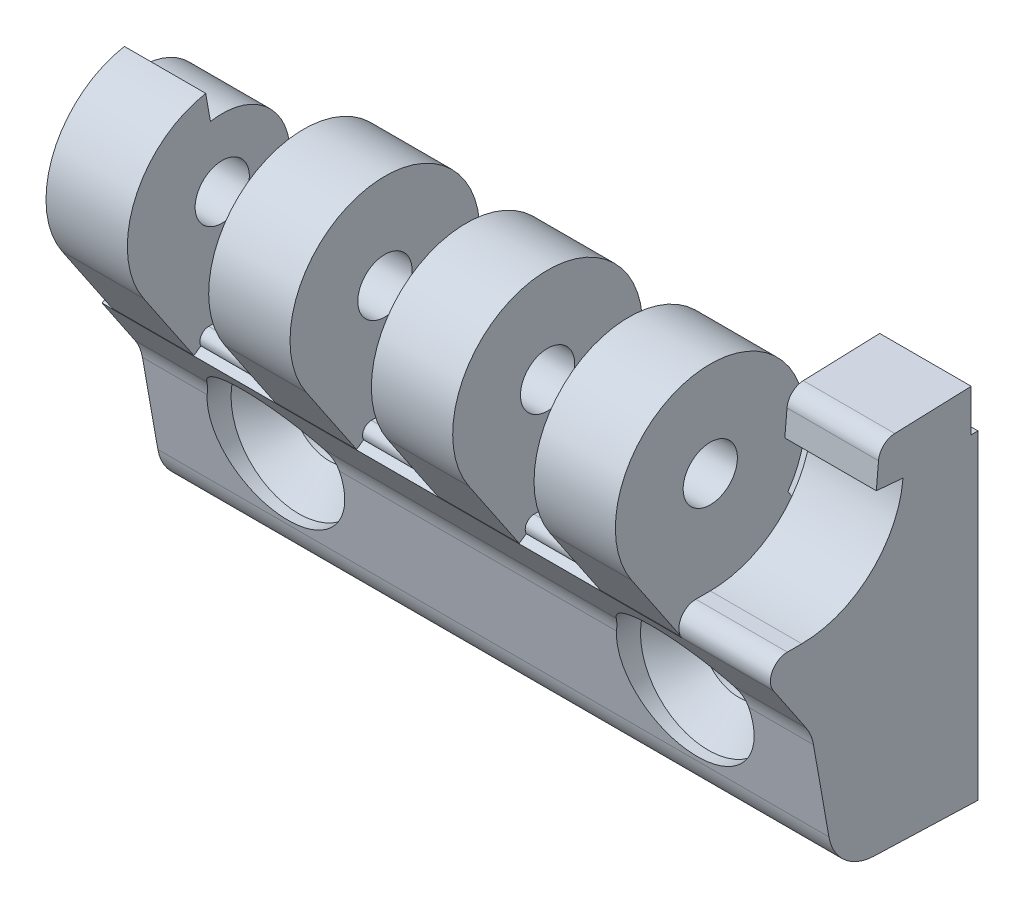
ISO-10303-21;
HEADER;
FILE_DESCRIPTION(('STEP AP214'),'2;1');
FILE_NAME('part.step','',(''),(''),'','','');
FILE_SCHEMA(('AUTOMOTIVE_DESIGN { 1 0 10303 214 1 1 1 1 }'));
ENDSEC;
DATA;
#1=APPLICATION_CONTEXT('core data for automotive mechanical design processes');
#2=APPLICATION_PROTOCOL_DEFINITION('international standard','automotive_design',2000,#1);
#3=PRODUCT_CONTEXT('',#1,'mechanical');
#4=PRODUCT('Part','Part','',(#3));
#5=PRODUCT_RELATED_PRODUCT_CATEGORY('part','',(#4));
#6=PRODUCT_DEFINITION_FORMATION('','',#4);
#7=PRODUCT_DEFINITION_CONTEXT('part definition',#1,'design');
#8=PRODUCT_DEFINITION('design','',#6,#7);
#9=PRODUCT_DEFINITION_SHAPE('','',#8);
#10=(LENGTH_UNIT() NAMED_UNIT(*) SI_UNIT(.MILLI.,.METRE.));
#11=(NAMED_UNIT(*) PLANE_ANGLE_UNIT() SI_UNIT($,.RADIAN.));
#12=(NAMED_UNIT(*) SI_UNIT($,.STERADIAN.) SOLID_ANGLE_UNIT());
#13=UNCERTAINTY_MEASURE_WITH_UNIT(LENGTH_MEASURE(1.E-05),#10,'distance_accuracy_value','');
#14=(GEOMETRIC_REPRESENTATION_CONTEXT(3) GLOBAL_UNCERTAINTY_ASSIGNED_CONTEXT((#13)) GLOBAL_UNIT_ASSIGNED_CONTEXT((#10,
#11,#12)) REPRESENTATION_CONTEXT('',''));
#15=CARTESIAN_POINT('',(0.,0.,0.));
#16=DIRECTION('',(0.,0.,1.));
#17=DIRECTION('',(1.,0.,0.));
#18=AXIS2_PLACEMENT_3D('',#15,#16,#17);
#19=CARTESIAN_POINT('',(33.1,6.75,14.));
#20=DIRECTION('',(1.,0.,0.));
#21=DIRECTION('',(0.,1.,0.));
#22=AXIS2_PLACEMENT_3D('',#19,#20,#21);
#23=CYLINDRICAL_SURFACE('',#22,0.65);
#24=CARTESIAN_POINT('',(9.1,6.75,14.));
#25=DIRECTION('',(1.,0.,0.));
#26=DIRECTION('',(0.,1.,0.));
#27=AXIS2_PLACEMENT_3D('',#24,#25,#26);
#28=CIRCLE('',#27,0.65);
#29=CARTESIAN_POINT('',(9.1,7.39999933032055,14.0009330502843));
#30=VERTEX_POINT('',#29);
#31=CARTESIAN_POINT('',(9.1,6.43759001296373,14.57));
#32=VERTEX_POINT('',#31);
#33=EDGE_CURVE('E387',#30,#32,#28,.T.);
#34=ORIENTED_EDGE('',*,*,#33,.T.);
#35=DIRECTION('',(1.,0.,0.));
#36=VECTOR('',#35,1.);
#37=CARTESIAN_POINT('',(33.1,6.43759001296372,14.57));
#38=LINE('',#37,#36);
#39=CARTESIAN_POINT('',(15.1,6.43759001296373,14.57));
#40=VERTEX_POINT('',#39);
#41=EDGE_CURVE('E385',#32,#40,#38,.T.);
#42=ORIENTED_EDGE('',*,*,#41,.T.);
#43=CARTESIAN_POINT('',(15.1,6.75,14.));
#44=DIRECTION('',(1.,0.,0.));
#45=DIRECTION('',(0.,1.,0.));
#46=AXIS2_PLACEMENT_3D('',#43,#44,#45);
#47=CIRCLE('',#46,0.65);
#48=CARTESIAN_POINT('',(15.1,7.39999933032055,14.0009330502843));
#49=VERTEX_POINT('',#48);
#50=EDGE_CURVE('E18',#40,#49,#47,.F.);
#51=ORIENTED_EDGE('',*,*,#50,.T.);
#52=DIRECTION('',(1.,0.,0.));
#53=VECTOR('',#52,1.);
#54=CARTESIAN_POINT('',(33.1,7.39999933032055,14.0009330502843));
#55=LINE('',#54,#53);
#56=EDGE_CURVE('E382',#49,#30,#55,.F.);
#57=ORIENTED_EDGE('',*,*,#56,.T.);
#58=EDGE_LOOP('',(#34,#42,#51,#57));
#59=FACE_BOUND('',#58,.T.);
#60=ADVANCED_FACE('F15',(#59),#23,.T.);
#61=CARTESIAN_POINT('',(33.1,6.75,14.));
#62=DIRECTION('',(1.,0.,0.));
#63=DIRECTION('',(0.,1.,0.));
#64=AXIS2_PLACEMENT_3D('',#61,#62,#63);
#65=CYLINDRICAL_SURFACE('',#64,0.65);
#66=CARTESIAN_POINT('',(-2.9,6.75,14.));
#67=DIRECTION('',(1.,0.,0.));
#68=DIRECTION('',(0.,1.,0.));
#69=AXIS2_PLACEMENT_3D('',#66,#67,#68);
#70=CIRCLE('',#69,0.65);
#71=CARTESIAN_POINT('',(-2.9,7.39999933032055,14.0009330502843));
#72=VERTEX_POINT('',#71);
#73=CARTESIAN_POINT('',(-2.9,6.43759001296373,14.57));
#74=VERTEX_POINT('',#73);
#75=EDGE_CURVE('E560',#72,#74,#70,.T.);
#76=ORIENTED_EDGE('',*,*,#75,.T.);
#77=DIRECTION('',(1.,0.,0.));
#78=VECTOR('',#77,1.);
#79=CARTESIAN_POINT('',(33.1,6.43759001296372,14.57));
#80=LINE('',#79,#78);
#81=CARTESIAN_POINT('',(3.1,6.43759001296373,14.57));
#82=VERTEX_POINT('',#81);
#83=EDGE_CURVE('E532',#74,#82,#80,.T.);
#84=ORIENTED_EDGE('',*,*,#83,.T.);
#85=CARTESIAN_POINT('',(3.1,6.75,14.));
#86=DIRECTION('',(1.,0.,0.));
#87=DIRECTION('',(0.,1.,0.));
#88=AXIS2_PLACEMENT_3D('',#85,#86,#87);
#89=CIRCLE('',#88,0.65);
#90=CARTESIAN_POINT('',(3.1,7.39999933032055,14.0009330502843));
#91=VERTEX_POINT('',#90);
#92=EDGE_CURVE('E1422',#82,#91,#89,.F.);
#93=ORIENTED_EDGE('',*,*,#92,.T.);
#94=DIRECTION('',(1.,0.,0.));
#95=VECTOR('',#94,1.);
#96=CARTESIAN_POINT('',(33.1,7.39999933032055,14.0009330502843));
#97=LINE('',#96,#95);
#98=EDGE_CURVE('E527',#91,#72,#97,.F.);
#99=ORIENTED_EDGE('',*,*,#98,.T.);
#100=EDGE_LOOP('',(#76,#84,#93,#99));
#101=FACE_BOUND('',#100,.T.);
#102=ADVANCED_FACE('F1412',(#101),#65,.T.);
#103=CARTESIAN_POINT('',(9.1,15.5,13.));
#104=DIRECTION('',(1.,0.,0.));
#105=DIRECTION('',(0.,1.,0.));
#106=AXIS2_PLACEMENT_3D('',#103,#104,#105);
#107=CYLINDRICAL_SURFACE('',#106,2.);
#108=CARTESIAN_POINT('',(3.1,15.5,13.));
#109=DIRECTION('',(1.,0.,0.));
#110=DIRECTION('',(0.,1.,0.));
#111=AXIS2_PLACEMENT_3D('',#108,#109,#110);
#112=CIRCLE('',#111,2.);
#113=CARTESIAN_POINT('',(3.1,17.5,13.));
#114=VERTEX_POINT('',#113);
#115=EDGE_CURVE('E530',#114,#114,#112,.F.);
#116=ORIENTED_EDGE('',*,*,#115,.T.);
#117=EDGE_LOOP('',(#116));
#118=FACE_BOUND('',#117,.T.);
#119=CARTESIAN_POINT('',(9.1,15.5,13.));
#120=DIRECTION('',(1.,0.,0.));
#121=DIRECTION('',(0.,1.,0.));
#122=AXIS2_PLACEMENT_3D('',#119,#120,#121);
#123=CIRCLE('',#122,2.);
#124=CARTESIAN_POINT('',(9.1,17.5,13.));
#125=VERTEX_POINT('',#124);
#126=EDGE_CURVE('E403',#125,#125,#123,.F.);
#127=ORIENTED_EDGE('',*,*,#126,.F.);
#128=EDGE_LOOP('',(#127));
#129=FACE_BOUND('',#128,.T.);
#130=ADVANCED_FACE('F1409',(#118,#129),#107,.F.);
#131=CARTESIAN_POINT('',(9.1,11.5856496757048,18.8032630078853));
#132=DIRECTION('',(0.,-0.559192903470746,0.829037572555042));
#133=DIRECTION('',(0.,-0.829037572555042,-0.559192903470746));
#134=AXIS2_PLACEMENT_3D('',#131,#132,#133);
#135=PLANE('',#134);
#136=DIRECTION('',(1.,0.,0.));
#137=VECTOR('',#136,1.);
#138=CARTESIAN_POINT('',(9.1,11.5856496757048,18.8032630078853));
#139=LINE('',#138,#137);
#140=CARTESIAN_POINT('',(9.1,11.5856496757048,18.8032630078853));
#141=VERTEX_POINT('',#140);
#142=CARTESIAN_POINT('',(3.1,11.5856496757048,18.8032630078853));
#143=VERTEX_POINT('',#142);
#144=EDGE_CURVE('E549',#141,#143,#139,.F.);
#145=ORIENTED_EDGE('',*,*,#144,.T.);
#146=DIRECTION('',(0.,-0.829037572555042,-0.559192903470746));
#147=VECTOR('',#146,1.);
#148=CARTESIAN_POINT('',(3.1,11.5856496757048,18.8032630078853));
#149=LINE('',#148,#147);
#150=CARTESIAN_POINT('',(3.1,6.08486474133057,15.0929367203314));
#151=VERTEX_POINT('',#150);
#152=EDGE_CURVE('E719',#143,#151,#149,.T.);
#153=ORIENTED_EDGE('',*,*,#152,.T.);
#154=DIRECTION('',(1.,0.,0.));
#155=VECTOR('',#154,1.);
#156=CARTESIAN_POINT('',(33.1,6.08486474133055,15.0929367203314));
#157=LINE('',#156,#155);
#158=CARTESIAN_POINT('',(9.1,6.08486474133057,15.0929367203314));
#159=VERTEX_POINT('',#158);
#160=EDGE_CURVE('E535',#151,#159,#157,.T.);
#161=ORIENTED_EDGE('',*,*,#160,.T.);
#162=DIRECTION('',(0.,-0.829037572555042,-0.559192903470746));
#163=VECTOR('',#162,1.);
#164=CARTESIAN_POINT('',(9.1,11.5856496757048,18.8032630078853));
#165=LINE('',#164,#163);
#166=EDGE_CURVE('E425',#141,#159,#165,.T.);
#167=ORIENTED_EDGE('',*,*,#166,.F.);
#168=EDGE_LOOP('',(#145,#153,#161,#167));
#169=FACE_BOUND('',#168,.T.);
#170=ADVANCED_FACE('F1405',(#169),#135,.T.);
#171=CARTESIAN_POINT('',(-2.9,15.5,13.));
#172=DIRECTION('',(1.,0.,0.));
#173=DIRECTION('',(0.,1.,0.));
#174=AXIS2_PLACEMENT_3D('',#171,#172,#173);
#175=CYLINDRICAL_SURFACE('',#174,5.);
#176=CARTESIAN_POINT('',(-2.9,15.5,13.));
#177=DIRECTION('',(1.,0.,0.));
#178=DIRECTION('',(0.,1.,0.));
#179=AXIS2_PLACEMENT_3D('',#176,#177,#178);
#180=CIRCLE('',#179,5.);
#181=CARTESIAN_POINT('',(-2.9,14.4120549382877,8.11979759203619));
#182=VERTEX_POINT('',#181);
#183=CARTESIAN_POINT('',(-2.9,20.424038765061,13.8682408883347));
#184=VERTEX_POINT('',#183);
#185=EDGE_CURVE('E699',#182,#184,#180,.T.);
#186=ORIENTED_EDGE('',*,*,#185,.F.);
#187=DIRECTION('',(1.,0.,0.));
#188=VECTOR('',#187,1.);
#189=CARTESIAN_POINT('',(-2.9,14.4120549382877,8.11979759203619));
#190=LINE('',#189,#188);
#191=CARTESIAN_POINT('',(-8.9,14.4120549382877,8.11979759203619));
#192=VERTEX_POINT('',#191);
#193=EDGE_CURVE('E550',#182,#192,#190,.F.);
#194=ORIENTED_EDGE('',*,*,#193,.T.);
#195=CARTESIAN_POINT('',(-8.9,15.5,13.));
#196=DIRECTION('',(1.,0.,0.));
#197=DIRECTION('',(0.,1.,0.));
#198=AXIS2_PLACEMENT_3D('',#195,#196,#197);
#199=CIRCLE('',#198,5.);
#200=CARTESIAN_POINT('',(-8.9,20.424038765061,13.8682408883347));
#201=VERTEX_POINT('',#200);
#202=EDGE_CURVE('E711',#192,#201,#199,.T.);
#203=ORIENTED_EDGE('',*,*,#202,.T.);
#204=DIRECTION('',(1.,0.,0.));
#205=VECTOR('',#204,1.);
#206=CARTESIAN_POINT('',(-2.9,20.424038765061,13.8682408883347));
#207=LINE('',#206,#205);
#208=EDGE_CURVE('E546',#184,#201,#207,.F.);
#209=ORIENTED_EDGE('',*,*,#208,.F.);
#210=EDGE_LOOP('',(#186,#194,#203,#209));
#211=FACE_BOUND('',#210,.T.);
#212=ADVANCED_FACE('F1401',(#211),#175,.T.);
#213=CARTESIAN_POINT('',(-2.9,20.424038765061,13.8682408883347));
#214=DIRECTION('',(0.,0.17364817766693,-0.984807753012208));
#215=DIRECTION('',(0.,0.984807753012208,0.17364817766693));
#216=AXIS2_PLACEMENT_3D('',#213,#214,#215);
#217=PLANE('',#216);
#218=DIRECTION('',(0.,0.984807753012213,0.173648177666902));
#219=VECTOR('',#218,1.);
#220=CARTESIAN_POINT('',(-2.9,20.424038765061,13.8682408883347));
#221=LINE('',#220,#219);
#222=CARTESIAN_POINT('',(-2.9,22.3936542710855,14.2155372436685));
#223=VERTEX_POINT('',#222);
#224=EDGE_CURVE('E698',#184,#223,#221,.T.);
#225=ORIENTED_EDGE('',*,*,#224,.F.);
#226=ORIENTED_EDGE('',*,*,#208,.T.);
#227=DIRECTION('',(0.,0.984807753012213,0.173648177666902));
#228=VECTOR('',#227,1.);
#229=CARTESIAN_POINT('',(-8.9,20.424038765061,13.8682408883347));
#230=LINE('',#229,#228);
#231=CARTESIAN_POINT('',(-8.9,22.3936542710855,14.2155372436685));
#232=VERTEX_POINT('',#231);
#233=EDGE_CURVE('E710',#201,#232,#230,.T.);
#234=ORIENTED_EDGE('',*,*,#233,.T.);
#235=DIRECTION('',(1.,0.,0.));
#236=VECTOR('',#235,1.);
#237=CARTESIAN_POINT('',(-2.9,22.3936542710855,14.2155372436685));
#238=LINE('',#237,#236);
#239=EDGE_CURVE('E543',#223,#232,#238,.F.);
#240=ORIENTED_EDGE('',*,*,#239,.F.);
#241=EDGE_LOOP('',(#225,#226,#234,#240));
#242=FACE_BOUND('',#241,.T.);
#243=ADVANCED_FACE('F1397',(#242),#217,.T.);
#244=CARTESIAN_POINT('',(-2.9,15.5,13.));
#245=DIRECTION('',(1.,0.,0.));
#246=DIRECTION('',(0.,1.,0.));
#247=AXIS2_PLACEMENT_3D('',#244,#245,#246);
#248=CYLINDRICAL_SURFACE('',#247,7.);
#249=CARTESIAN_POINT('',(-2.9,15.5,13.));
#250=DIRECTION('',(1.,0.,0.));
#251=DIRECTION('',(0.,1.,0.));
#252=AXIS2_PLACEMENT_3D('',#249,#250,#251);
#253=CIRCLE('',#252,7.);
#254=CARTESIAN_POINT('',(-2.9,11.5856496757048,18.8032630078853));
#255=VERTEX_POINT('',#254);
#256=EDGE_CURVE('E694',#223,#255,#253,.T.);
#257=ORIENTED_EDGE('',*,*,#256,.F.);
#258=ORIENTED_EDGE('',*,*,#239,.T.);
#259=CARTESIAN_POINT('',(-8.9,15.5,13.));
#260=DIRECTION('',(1.,0.,0.));
#261=DIRECTION('',(0.,1.,0.));
#262=AXIS2_PLACEMENT_3D('',#259,#260,#261);
#263=CIRCLE('',#262,7.);
#264=CARTESIAN_POINT('',(-8.9,11.5856496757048,18.8032630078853));
#265=VERTEX_POINT('',#264);
#266=EDGE_CURVE('E707',#232,#265,#263,.T.);
#267=ORIENTED_EDGE('',*,*,#266,.T.);
#268=DIRECTION('',(1.,0.,0.));
#269=VECTOR('',#268,1.);
#270=CARTESIAN_POINT('',(-2.9,11.5856496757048,18.8032630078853));
#271=LINE('',#270,#269);
#272=EDGE_CURVE('E540',#255,#265,#271,.F.);
#273=ORIENTED_EDGE('',*,*,#272,.F.);
#274=EDGE_LOOP('',(#257,#258,#267,#273));
#275=FACE_BOUND('',#274,.T.);
#276=ADVANCED_FACE('F1393',(#275),#248,.T.);
#277=CARTESIAN_POINT('',(-2.9,11.5856496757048,18.8032630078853));
#278=DIRECTION('',(0.,-0.559192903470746,0.829037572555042));
#279=DIRECTION('',(0.,-0.829037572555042,-0.559192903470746));
#280=AXIS2_PLACEMENT_3D('',#277,#278,#279);
#281=PLANE('',#280);
#282=ORIENTED_EDGE('',*,*,#272,.T.);
#283=DIRECTION('',(0.,-0.829037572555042,-0.559192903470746));
#284=VECTOR('',#283,1.);
#285=CARTESIAN_POINT('',(-8.9,11.5856496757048,18.8032630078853));
#286=LINE('',#285,#284);
#287=CARTESIAN_POINT('',(-8.9,6.08486474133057,15.0929367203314));
#288=VERTEX_POINT('',#287);
#289=EDGE_CURVE('E709',#265,#288,#286,.T.);
#290=ORIENTED_EDGE('',*,*,#289,.T.);
#291=DIRECTION('',(1.,0.,0.));
#292=VECTOR('',#291,1.);
#293=CARTESIAN_POINT('',(33.1,6.08486474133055,15.0929367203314));
#294=LINE('',#293,#292);
#295=CARTESIAN_POINT('',(-2.9,6.08486474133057,15.0929367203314));
#296=VERTEX_POINT('',#295);
#297=EDGE_CURVE('E536',#288,#296,#294,.T.);
#298=ORIENTED_EDGE('',*,*,#297,.T.);
#299=DIRECTION('',(0.,-0.829037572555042,-0.559192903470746));
#300=VECTOR('',#299,1.);
#301=CARTESIAN_POINT('',(-2.9,11.5856496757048,18.8032630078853));
#302=LINE('',#301,#300);
#303=EDGE_CURVE('E697',#255,#296,#302,.T.);
#304=ORIENTED_EDGE('',*,*,#303,.F.);
#305=EDGE_LOOP('',(#282,#290,#298,#304));
#306=FACE_BOUND('',#305,.T.);
#307=ADVANCED_FACE('F1389',(#306),#281,.T.);
#308=CARTESIAN_POINT('',(-2.9,15.5,13.));
#309=DIRECTION('',(1.,0.,0.));
#310=DIRECTION('',(0.,1.,0.));
#311=AXIS2_PLACEMENT_3D('',#308,#309,#310);
#312=CYLINDRICAL_SURFACE('',#311,2.);
#313=CARTESIAN_POINT('',(-8.9,15.5,13.));
#314=DIRECTION('',(1.,0.,0.));
#315=DIRECTION('',(0.,1.,0.));
#316=AXIS2_PLACEMENT_3D('',#313,#314,#315);
#317=CIRCLE('',#316,2.);
#318=CARTESIAN_POINT('',(-8.9,17.5,13.));
#319=VERTEX_POINT('',#318);
#320=EDGE_CURVE('E713',#319,#319,#317,.F.);
#321=ORIENTED_EDGE('',*,*,#320,.T.);
#322=EDGE_LOOP('',(#321));
#323=FACE_BOUND('',#322,.T.);
#324=CARTESIAN_POINT('',(-2.9,15.5,13.));
#325=DIRECTION('',(1.,0.,0.));
#326=DIRECTION('',(0.,1.,0.));
#327=AXIS2_PLACEMENT_3D('',#324,#325,#326);
#328=CIRCLE('',#327,2.);
#329=CARTESIAN_POINT('',(-2.9,17.5,13.));
#330=VERTEX_POINT('',#329);
#331=EDGE_CURVE('E690',#330,#330,#328,.F.);
#332=ORIENTED_EDGE('',*,*,#331,.F.);
#333=EDGE_LOOP('',(#332));
#334=FACE_BOUND('',#333,.T.);
#335=ADVANCED_FACE('F1385',(#323,#334),#312,.F.);
#336=CARTESIAN_POINT('',(33.1,15.5,13.));
#337=DIRECTION('',(1.,0.,0.));
#338=DIRECTION('',(0.,1.,0.));
#339=AXIS2_PLACEMENT_3D('',#336,#337,#338);
#340=CYLINDRICAL_SURFACE('',#339,2.);
#341=CARTESIAN_POINT('',(27.1,15.5,13.));
#342=DIRECTION('',(1.,0.,0.));
#343=DIRECTION('',(0.,1.,0.));
#344=AXIS2_PLACEMENT_3D('',#341,#342,#343);
#345=CIRCLE('',#344,2.);
#346=CARTESIAN_POINT('',(27.1,17.5,13.));
#347=VERTEX_POINT('',#346);
#348=EDGE_CURVE('E686',#347,#347,#345,.F.);
#349=ORIENTED_EDGE('',*,*,#348,.T.);
#350=EDGE_LOOP('',(#349));
#351=FACE_BOUND('',#350,.T.);
#352=CARTESIAN_POINT('',(33.1,15.5,13.));
#353=DIRECTION('',(1.,0.,0.));
#354=DIRECTION('',(0.,1.,0.));
#355=AXIS2_PLACEMENT_3D('',#352,#353,#354);
#356=CIRCLE('',#355,2.);
#357=CARTESIAN_POINT('',(33.1,17.5,13.));
#358=VERTEX_POINT('',#357);
#359=EDGE_CURVE('E485',#358,#358,#356,.F.);
#360=ORIENTED_EDGE('',*,*,#359,.F.);
#361=EDGE_LOOP('',(#360));
#362=FACE_BOUND('',#361,.T.);
#363=ADVANCED_FACE('F1382',(#351,#362),#340,.F.);
#364=CARTESIAN_POINT('',(33.1,11.5856496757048,18.8032630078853));
#365=DIRECTION('',(0.,-0.559192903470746,0.829037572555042));
#366=DIRECTION('',(0.,-0.829037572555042,-0.559192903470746));
#367=AXIS2_PLACEMENT_3D('',#364,#365,#366);
#368=PLANE('',#367);
#369=DIRECTION('',(1.,0.,0.));
#370=VECTOR('',#369,1.);
#371=CARTESIAN_POINT('',(33.1,11.5856496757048,18.8032630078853));
#372=LINE('',#371,#370);
#373=CARTESIAN_POINT('',(27.1,11.5856496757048,18.8032630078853));
#374=VERTEX_POINT('',#373);
#375=CARTESIAN_POINT('',(33.1,11.5856496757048,18.8032630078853));
#376=VERTEX_POINT('',#375);
#377=EDGE_CURVE('E493',#374,#376,#372,.T.);
#378=ORIENTED_EDGE('',*,*,#377,.F.);
#379=DIRECTION('',(0.,-0.829037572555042,-0.559192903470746));
#380=VECTOR('',#379,1.);
#381=CARTESIAN_POINT('',(27.1,11.5856496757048,18.8032630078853));
#382=LINE('',#381,#380);
#383=CARTESIAN_POINT('',(27.1,6.08486474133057,15.0929367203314));
#384=VERTEX_POINT('',#383);
#385=EDGE_CURVE('E689',#374,#384,#382,.T.);
#386=ORIENTED_EDGE('',*,*,#385,.T.);
#387=DIRECTION('',(1.,0.,0.));
#388=VECTOR('',#387,1.);
#389=CARTESIAN_POINT('',(33.1,6.08486474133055,15.0929367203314));
#390=LINE('',#389,#388);
#391=CARTESIAN_POINT('',(33.1,6.08486474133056,15.0929367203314));
#392=VERTEX_POINT('',#391);
#393=EDGE_CURVE('E479',#384,#392,#390,.T.);
#394=ORIENTED_EDGE('',*,*,#393,.T.);
#395=DIRECTION('',(0.,0.829037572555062,0.559192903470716));
#396=VECTOR('',#395,1.);
#397=CARTESIAN_POINT('',(33.1,6.08486474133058,15.0929367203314));
#398=LINE('',#397,#396);
#399=CARTESIAN_POINT('',(33.1,6.26475642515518,15.2142751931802));
#400=VERTEX_POINT('',#399);
#401=EDGE_CURVE('E482',#392,#400,#398,.T.);
#402=ORIENTED_EDGE('',*,*,#401,.T.);
#403=DIRECTION('',(0.,-0.829037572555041,-0.559192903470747));
#404=VECTOR('',#403,1.);
#405=CARTESIAN_POINT('',(33.1,11.5856496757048,18.8032630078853));
#406=LINE('',#405,#404);
#407=EDGE_CURVE('E490',#376,#400,#406,.T.);
#408=ORIENTED_EDGE('',*,*,#407,.F.);
#409=EDGE_LOOP('',(#378,#386,#394,#402,#408));
#410=FACE_BOUND('',#409,.T.);
#411=ADVANCED_FACE('F1317',(#410),#368,.T.);
#412=CARTESIAN_POINT('',(33.1,6.75,14.));
#413=DIRECTION('',(1.,0.,0.));
#414=DIRECTION('',(0.,1.,0.));
#415=AXIS2_PLACEMENT_3D('',#412,#413,#414);
#416=CYLINDRICAL_SURFACE('',#415,0.65);
#417=CARTESIAN_POINT('',(27.1,6.75,14.));
#418=DIRECTION('',(1.,0.,0.));
#419=DIRECTION('',(0.,1.,0.));
#420=AXIS2_PLACEMENT_3D('',#417,#418,#419);
#421=CIRCLE('',#420,0.65);
#422=CARTESIAN_POINT('',(27.1,6.43759001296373,14.57));
#423=VERTEX_POINT('',#422);
#424=CARTESIAN_POINT('',(27.1,7.39999933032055,14.0009330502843));
#425=VERTEX_POINT('',#424);
#426=EDGE_CURVE('E682',#423,#425,#421,.F.);
#427=ORIENTED_EDGE('',*,*,#426,.T.);
#428=DIRECTION('',(1.,0.,0.));
#429=VECTOR('',#428,1.);
#430=CARTESIAN_POINT('',(33.1,7.39999933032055,14.0009330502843));
#431=LINE('',#430,#429);
#432=CARTESIAN_POINT('',(21.1,7.39999933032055,14.0009330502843));
#433=VERTEX_POINT('',#432);
#434=EDGE_CURVE('E513',#425,#433,#431,.F.);
#435=ORIENTED_EDGE('',*,*,#434,.T.);
#436=CARTESIAN_POINT('',(21.1,6.75,14.));
#437=DIRECTION('',(1.,0.,0.));
#438=DIRECTION('',(0.,1.,0.));
#439=AXIS2_PLACEMENT_3D('',#436,#437,#438);
#440=CIRCLE('',#439,0.65);
#441=CARTESIAN_POINT('',(21.1,6.43759001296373,14.57));
#442=VERTEX_POINT('',#441);
#443=EDGE_CURVE('E512',#433,#442,#440,.T.);
#444=ORIENTED_EDGE('',*,*,#443,.T.);
#445=DIRECTION('',(1.,0.,0.));
#446=VECTOR('',#445,1.);
#447=CARTESIAN_POINT('',(33.1,6.43759001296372,14.57));
#448=LINE('',#447,#446);
#449=EDGE_CURVE('E484',#442,#423,#448,.T.);
#450=ORIENTED_EDGE('',*,*,#449,.T.);
#451=EDGE_LOOP('',(#427,#435,#444,#450));
#452=FACE_BOUND('',#451,.T.);
#453=ADVANCED_FACE('F1309',(#452),#416,.T.);
#454=CARTESIAN_POINT('',(15.1,15.5,13.));
#455=DIRECTION('',(-1.,0.,0.));
#456=DIRECTION('',(0.,-1.,0.));
#457=AXIS2_PLACEMENT_3D('',#454,#455,#456);
#458=CYLINDRICAL_SURFACE('',#457,2.);
#459=CARTESIAN_POINT('',(15.1,15.5,13.));
#460=DIRECTION('',(-1.,0.,0.));
#461=DIRECTION('',(0.,-1.,0.));
#462=AXIS2_PLACEMENT_3D('',#459,#460,#461);
#463=CIRCLE('',#462,2.);
#464=CARTESIAN_POINT('',(15.1,13.5,13.));
#465=VERTEX_POINT('',#464);
#466=EDGE_CURVE('E724',#465,#465,#463,.T.);
#467=ORIENTED_EDGE('',*,*,#466,.T.);
#468=EDGE_LOOP('',(#467));
#469=FACE_BOUND('',#468,.T.);
#470=CARTESIAN_POINT('',(21.1,15.5,13.));
#471=DIRECTION('',(-1.,0.,0.));
#472=DIRECTION('',(0.,-1.,0.));
#473=AXIS2_PLACEMENT_3D('',#470,#471,#472);
#474=CIRCLE('',#473,2.);
#475=CARTESIAN_POINT('',(21.1,13.5,13.));
#476=VERTEX_POINT('',#475);
#477=EDGE_CURVE('E516',#476,#476,#474,.T.);
#478=ORIENTED_EDGE('',*,*,#477,.F.);
#479=EDGE_LOOP('',(#478));
#480=FACE_BOUND('',#479,.T.);
#481=ADVANCED_FACE('F1374',(#469,#480),#458,.F.);
#482=CARTESIAN_POINT('',(15.1,3.2952739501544,13.2113339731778));
#483=DIRECTION('',(0.,-0.559192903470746,0.829037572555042));
#484=DIRECTION('',(0.,-0.829037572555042,-0.559192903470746));
#485=AXIS2_PLACEMENT_3D('',#482,#483,#484);
#486=PLANE('',#485);
#487=DIRECTION('',(1.,0.,0.));
#488=VECTOR('',#487,1.);
#489=CARTESIAN_POINT('',(15.1,11.5856496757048,18.8032630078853));
#490=LINE('',#489,#488);
#491=CARTESIAN_POINT('',(21.1,11.5856496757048,18.8032630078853));
#492=VERTEX_POINT('',#491);
#493=CARTESIAN_POINT('',(15.1,11.5856496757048,18.8032630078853));
#494=VERTEX_POINT('',#493);
#495=EDGE_CURVE('E509',#492,#494,#490,.F.);
#496=ORIENTED_EDGE('',*,*,#495,.T.);
#497=DIRECTION('',(0.,-0.829037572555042,-0.559192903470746));
#498=VECTOR('',#497,1.);
#499=CARTESIAN_POINT('',(15.1,11.5856496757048,18.8032630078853));
#500=LINE('',#499,#498);
#501=CARTESIAN_POINT('',(15.1,6.08486474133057,15.0929367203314));
#502=VERTEX_POINT('',#501);
#503=EDGE_CURVE('E728',#494,#502,#500,.T.);
#504=ORIENTED_EDGE('',*,*,#503,.T.);
#505=DIRECTION('',(1.,0.,0.));
#506=VECTOR('',#505,1.);
#507=CARTESIAN_POINT('',(33.1,6.08486474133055,15.0929367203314));
#508=LINE('',#507,#506);
#509=CARTESIAN_POINT('',(21.1,6.08486474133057,15.0929367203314));
#510=VERTEX_POINT('',#509);
#511=EDGE_CURVE('E468',#502,#510,#508,.T.);
#512=ORIENTED_EDGE('',*,*,#511,.T.);
#513=DIRECTION('',(0.,-0.829037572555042,-0.559192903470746));
#514=VECTOR('',#513,1.);
#515=CARTESIAN_POINT('',(21.1,11.5856496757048,18.8032630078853));
#516=LINE('',#515,#514);
#517=EDGE_CURVE('E508',#492,#510,#516,.T.);
#518=ORIENTED_EDGE('',*,*,#517,.F.);
#519=EDGE_LOOP('',(#496,#504,#512,#518));
#520=FACE_BOUND('',#519,.T.);
#521=ADVANCED_FACE('F1370',(#520),#486,.T.);
#522=CARTESIAN_POINT('',(33.1,15.5,0.));
#523=DIRECTION('',(1.,0.,0.));
#524=DIRECTION('',(0.,1.,0.));
#525=AXIS2_PLACEMENT_3D('',#522,#523,#524);
#526=PLANE('',#525);
#527=ORIENTED_EDGE('',*,*,#359,.T.);
#528=EDGE_LOOP('',(#527));
#529=FACE_BOUND('',#528,.T.);
#530=DIRECTION('',(0.,-0.0871557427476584,-0.996194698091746));
#531=VECTOR('',#530,1.);
#532=CARTESIAN_POINT('',(33.1,15.0225084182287,7.5));
#533=LINE('',#532,#531);
#534=CARTESIAN_POINT('',(33.1,15.0225084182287,7.5));
#535=VERTEX_POINT('',#534);
#536=CARTESIAN_POINT('',(33.1,14.8935778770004,6.02631717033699));
#537=VERTEX_POINT('',#536);
#538=EDGE_CURVE('E1108',#535,#537,#533,.T.);
#539=ORIENTED_EDGE('',*,*,#538,.F.);
#540=DIRECTION('',(0.,-0.996194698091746,0.0871557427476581));
#541=VECTOR('',#540,1.);
#542=CARTESIAN_POINT('',(33.1,16.8628447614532,7.33899143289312));
#543=LINE('',#542,#541);
#544=CARTESIAN_POINT('',(33.1,16.8628447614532,7.33899143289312));
#545=VERTEX_POINT('',#544);
#546=EDGE_CURVE('E494',#545,#535,#543,.T.);
#547=ORIENTED_EDGE('',*,*,#546,.F.);
#548=CARTESIAN_POINT('',(33.1,16.7539000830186,6.09374806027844));
#549=DIRECTION('',(1.,0.,0.));
#550=DIRECTION('',(0.,1.,0.));
#551=AXIS2_PLACEMENT_3D('',#548,#549,#550);
#552=CIRCLE('',#551,1.25);
#553=CARTESIAN_POINT('',(33.1,17.9537783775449,6.44416506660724));
#554=VERTEX_POINT('',#553);
#555=EDGE_CURVE('E664',#554,#545,#552,.T.);
#556=ORIENTED_EDGE('',*,*,#555,.F.);
#557=CARTESIAN_POINT('',(33.1,15.5,13.));
#558=DIRECTION('',(1.,0.,0.));
#559=DIRECTION('',(0.,1.,0.));
#560=AXIS2_PLACEMENT_3D('',#557,#558,#559);
#561=CIRCLE('',#560,7.);
#562=EDGE_CURVE('E504',#376,#554,#561,.F.);
#563=ORIENTED_EDGE('',*,*,#562,.F.);
#564=ORIENTED_EDGE('',*,*,#407,.T.);
#565=CARTESIAN_POINT('',(33.1,6.75,14.0623035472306));
#566=DIRECTION('',(1.,0.,0.));
#567=DIRECTION('',(0.,1.,0.));
#568=AXIS2_PLACEMENT_3D('',#565,#566,#567);
#569=CIRCLE('',#568,1.25);
#570=CARTESIAN_POINT('',(33.1,8.,14.0623035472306));
#571=VERTEX_POINT('',#570);
#572=EDGE_CURVE('E657',#571,#400,#569,.T.);
#573=ORIENTED_EDGE('',*,*,#572,.F.);
#574=DIRECTION('',(0.,0.,1.));
#575=VECTOR('',#574,1.);
#576=CARTESIAN_POINT('',(33.1,8.,13.));
#577=LINE('',#576,#575);
#578=CARTESIAN_POINT('',(33.1,8.,13.));
#579=VERTEX_POINT('',#578);
#580=EDGE_CURVE('E465',#579,#571,#577,.T.);
#581=ORIENTED_EDGE('',*,*,#580,.F.);
#582=CARTESIAN_POINT('',(33.1,15.5,13.));
#583=DIRECTION('',(1.,0.,0.));
#584=DIRECTION('',(0.,1.,0.));
#585=AXIS2_PLACEMENT_3D('',#582,#583,#584);
#586=CIRCLE('',#585,7.5);
#587=CARTESIAN_POINT('',(33.1,11.0358013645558,6.9733151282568));
#588=VERTEX_POINT('',#587);
#589=EDGE_CURVE('E660',#579,#588,#586,.T.);
#590=ORIENTED_EDGE('',*,*,#589,.T.);
#591=DIRECTION('',(0.,0.829037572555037,0.559192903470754));
#592=VECTOR('',#591,1.);
#593=CARTESIAN_POINT('',(33.1,11.0358013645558,6.9733151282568));
#594=LINE('',#593,#592);
#595=CARTESIAN_POINT('',(33.1,11.4774457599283,7.27120803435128));
#596=VERTEX_POINT('',#595);
#597=EDGE_CURVE('E488',#588,#596,#594,.T.);
#598=ORIENTED_EDGE('',*,*,#597,.T.);
#599=CARTESIAN_POINT('',(33.1,15.5,13.));
#600=DIRECTION('',(1.,0.,0.));
#601=DIRECTION('',(0.,1.,0.));
#602=AXIS2_PLACEMENT_3D('',#599,#600,#601);
#603=CIRCLE('',#602,7.);
#604=EDGE_CURVE('E670',#537,#596,#603,.F.);
#605=ORIENTED_EDGE('',*,*,#604,.F.);
#606=EDGE_LOOP('',(#539,#547,#556,#563,#564,#573,#581,#590,#598,#605));
#607=FACE_BOUND('',#606,.T.);
#608=ADVANCED_FACE('F1323',(#529,#607),#526,.T.);
#609=CARTESIAN_POINT('',(33.1,15.5,0.));
#610=DIRECTION('',(1.,0.,0.));
#611=DIRECTION('',(0.,1.,0.));
#612=AXIS2_PLACEMENT_3D('',#609,#610,#611);
#613=PLANE('',#612);
#614=DIRECTION('',(0.,0.559192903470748,-0.829037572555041));
#615=VECTOR('',#614,1.);
#616=CARTESIAN_POINT('',(33.1,5.87839710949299,15.399037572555));
#617=LINE('',#616,#615);
#618=CARTESIAN_POINT('',(33.1,6.07179113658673,15.1123191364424));
#619=VERTEX_POINT('',#618);
#620=EDGE_CURVE('E477',#392,#619,#617,.F.);
#621=ORIENTED_EDGE('',*,*,#620,.T.);
#622=CARTESIAN_POINT('',(33.1,6.75,14.0623035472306));
#623=DIRECTION('',(1.,0.,0.));
#624=DIRECTION('',(0.,1.,0.));
#625=AXIS2_PLACEMENT_3D('',#622,#623,#624);
#626=CIRCLE('',#625,1.25);
#627=EDGE_CURVE('E473',#400,#619,#626,.T.);
#628=ORIENTED_EDGE('',*,*,#627,.F.);
#629=ORIENTED_EDGE('',*,*,#401,.F.);
#630=EDGE_LOOP('',(#621,#628,#629));
#631=FACE_BOUND('',#630,.T.);
#632=ADVANCED_FACE('F1320',(#631),#613,.F.);
#633=CARTESIAN_POINT('',(33.1,5.87839710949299,15.399037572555));
#634=DIRECTION('',(0.,-0.829037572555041,-0.559192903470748));
#635=DIRECTION('',(0.,0.559192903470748,-0.829037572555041));
#636=AXIS2_PLACEMENT_3D('',#633,#634,#635);
#637=PLANE('',#636);
#638=ORIENTED_EDGE('',*,*,#511,.F.);
#639=DIRECTION('',(0.,0.55919290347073,-0.829037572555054));
#640=VECTOR('',#639,1.);
#641=CARTESIAN_POINT('',(15.1,6.08486474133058,15.0929367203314));
#642=LINE('',#641,#640);
#643=EDGE_CURVE('E727',#502,#40,#642,.T.);
#644=ORIENTED_EDGE('',*,*,#643,.T.);
#645=ORIENTED_EDGE('',*,*,#41,.F.);
#646=DIRECTION('',(0.,0.55919290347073,-0.829037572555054));
#647=VECTOR('',#646,1.);
#648=CARTESIAN_POINT('',(9.1,6.08486474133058,15.0929367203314));
#649=LINE('',#648,#647);
#650=EDGE_CURVE('E422',#159,#32,#649,.T.);
#651=ORIENTED_EDGE('',*,*,#650,.F.);
#652=ORIENTED_EDGE('',*,*,#160,.F.);
#653=DIRECTION('',(0.,0.55919290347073,-0.829037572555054));
#654=VECTOR('',#653,1.);
#655=CARTESIAN_POINT('',(3.1,6.08486474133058,15.0929367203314));
#656=LINE('',#655,#654);
#657=EDGE_CURVE('E1010',#151,#82,#656,.T.);
#658=ORIENTED_EDGE('',*,*,#657,.T.);
#659=ORIENTED_EDGE('',*,*,#83,.F.);
#660=DIRECTION('',(0.,0.55919290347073,-0.829037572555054));
#661=VECTOR('',#660,1.);
#662=CARTESIAN_POINT('',(-2.9,6.08486474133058,15.0929367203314));
#663=LINE('',#662,#661);
#664=EDGE_CURVE('E1058',#296,#74,#663,.T.);
#665=ORIENTED_EDGE('',*,*,#664,.F.);
#666=ORIENTED_EDGE('',*,*,#297,.F.);
#667=DIRECTION('',(0.,0.55919290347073,-0.829037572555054));
#668=VECTOR('',#667,1.);
#669=CARTESIAN_POINT('',(-8.9,6.08486474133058,15.0929367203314));
#670=LINE('',#669,#668);
#671=CARTESIAN_POINT('',(-8.9,6.43759001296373,14.57));
#672=VERTEX_POINT('',#671);
#673=EDGE_CURVE('E1024',#288,#672,#670,.T.);
#674=ORIENTED_EDGE('',*,*,#673,.T.);
#675=DIRECTION('',(1.,0.,0.));
#676=VECTOR('',#675,1.);
#677=CARTESIAN_POINT('',(33.1,6.43759001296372,14.57));
#678=LINE('',#677,#676);
#679=CARTESIAN_POINT('',(-9.65,6.43759001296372,14.57));
#680=VERTEX_POINT('',#679);
#681=EDGE_CURVE('E476',#680,#672,#678,.T.);
#682=ORIENTED_EDGE('',*,*,#681,.F.);
#683=DIRECTION('',(0.,0.559192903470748,-0.829037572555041));
#684=VECTOR('',#683,1.);
#685=CARTESIAN_POINT('',(-9.65,5.87839710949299,15.399037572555));
#686=LINE('',#685,#684);
#687=CARTESIAN_POINT('',(-9.65,6.07179113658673,15.1123191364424));
#688=VERTEX_POINT('',#687);
#689=EDGE_CURVE('E474',#688,#680,#686,.T.);
#690=ORIENTED_EDGE('',*,*,#689,.F.);
#691=DIRECTION('',(1.,0.,0.));
#692=VECTOR('',#691,1.);
#693=CARTESIAN_POINT('',(39.85,6.07179113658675,15.1123191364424));
#694=LINE('',#693,#692);
#695=EDGE_CURVE('E469',#619,#688,#694,.F.);
#696=ORIENTED_EDGE('',*,*,#695,.F.);
#697=ORIENTED_EDGE('',*,*,#620,.F.);
#698=ORIENTED_EDGE('',*,*,#393,.F.);
#699=DIRECTION('',(0.,0.55919290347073,-0.829037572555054));
#700=VECTOR('',#699,1.);
#701=CARTESIAN_POINT('',(27.1,6.08486474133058,15.0929367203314));
#702=LINE('',#701,#700);
#703=EDGE_CURVE('E685',#384,#423,#702,.T.);
#704=ORIENTED_EDGE('',*,*,#703,.T.);
#705=ORIENTED_EDGE('',*,*,#449,.F.);
#706=DIRECTION('',(0.,0.55919290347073,-0.829037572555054));
#707=VECTOR('',#706,1.);
#708=CARTESIAN_POINT('',(21.1,6.08486474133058,15.0929367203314));
#709=LINE('',#708,#707);
#710=EDGE_CURVE('E681',#510,#442,#709,.T.);
#711=ORIENTED_EDGE('',*,*,#710,.F.);
#712=EDGE_LOOP('',(#638,#644,#645,#651,#652,#658,#659,#665,#666,#674,#682,#690,#696,#697,#698,
#704,#705,#711));
#713=FACE_BOUND('',#712,.T.);
#714=ADVANCED_FACE('F1265',(#713),#637,.F.);
#715=CARTESIAN_POINT('',(39.85,8.,13.));
#716=DIRECTION('',(0.,1.,0.));
#717=DIRECTION('',(-1.,0.,0.));
#718=AXIS2_PLACEMENT_3D('',#715,#716,#717);
#719=PLANE('',#718);
#720=DIRECTION('',(0.,0.,1.));
#721=VECTOR('',#720,1.);
#722=CARTESIAN_POINT('',(39.85,8.,13.));
#723=LINE('',#722,#721);
#724=CARTESIAN_POINT('',(39.85,8.,14.0623035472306));
#725=VERTEX_POINT('',#724);
#726=CARTESIAN_POINT('',(39.85,8.,13.));
#727=VERTEX_POINT('',#726);
#728=EDGE_CURVE('E462',#725,#727,#723,.F.);
#729=ORIENTED_EDGE('',*,*,#728,.T.);
#730=DIRECTION('',(1.,0.,0.));
#731=VECTOR('',#730,1.);
#732=CARTESIAN_POINT('',(39.85,8.,13.));
#733=LINE('',#732,#731);
#734=EDGE_CURVE('E663',#727,#579,#733,.F.);
#735=ORIENTED_EDGE('',*,*,#734,.T.);
#736=ORIENTED_EDGE('',*,*,#580,.T.);
#737=DIRECTION('',(1.,0.,0.));
#738=VECTOR('',#737,1.);
#739=CARTESIAN_POINT('',(39.85,8.,14.0623035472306));
#740=LINE('',#739,#738);
#741=EDGE_CURVE('E654',#725,#571,#740,.F.);
#742=ORIENTED_EDGE('',*,*,#741,.F.);
#743=EDGE_LOOP('',(#729,#735,#736,#742));
#744=FACE_BOUND('',#743,.T.);
#745=ADVANCED_FACE('F791',(#744),#719,.T.);
#746=CARTESIAN_POINT('',(0.,0.,15.125));
#747=DIRECTION('',(0.,0.,-1.));
#748=DIRECTION('',(-1.,0.,0.));
#749=AXIS2_PLACEMENT_3D('',#746,#747,#748);
#750=CYLINDRICAL_SURFACE('',#749,5.);
#751=CARTESIAN_POINT('',(0.,0.,11.938779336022));
#752=DIRECTION('',(0.,-0.17364817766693,0.984807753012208));
#753=DIRECTION('',(0.,-0.984807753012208,-0.17364817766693));
#754=AXIS2_PLACEMENT_3D('',#751,#752,#753);
#755=ELLIPSE('',#754,5.07713305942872,5.);
#756=CARTESIAN_POINT('',(4.87355305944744,1.1173542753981,12.1357990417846));
#757=VERTEX_POINT('',#756);
#758=CARTESIAN_POINT('',(-4.87355305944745,1.1173542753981,12.1357990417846));
#759=VERTEX_POINT('',#758);
#760=EDGE_CURVE('E635',#757,#759,#755,.F.);
#761=ORIENTED_EDGE('',*,*,#760,.F.);
#762=CARTESIAN_POINT('',(4.87355305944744,1.1173542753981,12.1357990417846));
#763=CARTESIAN_POINT('',(4.85193310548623,1.21173855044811,12.1524280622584));
#764=CARTESIAN_POINT('',(4.82769138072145,1.3048067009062,12.1728477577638));
#765=CARTESIAN_POINT('',(4.77450240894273,1.48766075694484,12.2207415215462));
#766=CARTESIAN_POINT('',(4.74555844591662,1.57744890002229,12.2482106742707));
#767=CARTESIAN_POINT('',(4.68401672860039,1.75168222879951,12.3091609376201));
#768=CARTESIAN_POINT('',(4.65149207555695,1.83619355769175,12.3425279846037));
#769=CARTESIAN_POINT('',(4.5829359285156,2.0011674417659,12.4150877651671));
#770=CARTESIAN_POINT('',(4.5469052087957,2.08163088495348,12.4542792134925));
#771=CARTESIAN_POINT('',(4.48401572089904,2.21292986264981,12.5244842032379));
#772=CARTESIAN_POINT('',(4.45795635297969,2.26493595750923,12.5540468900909));
#773=CARTESIAN_POINT('',(4.40449043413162,2.36723816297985,12.6156895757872));
#774=CARTESIAN_POINT('',(4.37707662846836,2.41752189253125,12.6477838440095));
#775=CARTESIAN_POINT('',(4.34914831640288,2.46676081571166,12.6809946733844));
#776=B_SPLINE_CURVE_WITH_KNOTS('',3,(#762,#763,#764,#765,#766,#767,#768,#769,#770,#771,#772,
#773,#774,#775),.UNSPECIFIED.,.F.,.F.,(4,2,2,2,2,2,4),(0.,0.294557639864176,0.588910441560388,
0.878093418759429,1.16721267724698,1.36288716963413,1.5597565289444),.UNSPECIFIED.);
#777=CARTESIAN_POINT('',(4.3491483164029,2.4667608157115,12.6809946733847));
#778=VERTEX_POINT('',#777);
#779=EDGE_CURVE('E395',#757,#778,#776,.T.);
#780=ORIENTED_EDGE('',*,*,#779,.T.);
#781=CARTESIAN_POINT('',(0.,0.,11.0171434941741));
#782=DIRECTION('',(0.,-0.559192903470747,0.829037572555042));
#783=DIRECTION('',(0.,-0.829037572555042,-0.559192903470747));
#784=AXIS2_PLACEMENT_3D('',#781,#782,#783);
#785=ELLIPSE('',#784,6.03108974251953,5.);
#786=CARTESIAN_POINT('',(-4.3491483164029,2.4667608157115,12.6809946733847));
#787=VERTEX_POINT('',#786);
#788=EDGE_CURVE('E644',#787,#778,#785,.F.);
#789=ORIENTED_EDGE('',*,*,#788,.F.);
#790=CARTESIAN_POINT('',(-4.3491483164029,2.4667608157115,12.6809946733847));
#791=CARTESIAN_POINT('',(-4.39092523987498,2.39312046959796,12.6313231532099));
#792=CARTESIAN_POINT('',(-4.43155658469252,2.31710809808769,12.5841320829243));
#793=CARTESIAN_POINT('',(-4.51000550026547,2.16044340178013,12.4951029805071));
#794=CARTESIAN_POINT('',(-4.54781850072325,2.07978390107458,12.453273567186));
#795=CARTESIAN_POINT('',(-4.61926221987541,1.91579290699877,12.3762851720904));
#796=CARTESIAN_POINT('',(-4.65296056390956,1.83254515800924,12.3410111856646));
#797=CARTESIAN_POINT('',(-4.71644900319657,1.6623317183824,12.2766552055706));
#798=CARTESIAN_POINT('',(-4.74624281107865,1.57536966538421,12.2475673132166));
#799=CARTESIAN_POINT('',(-4.79251603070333,1.4267925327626,12.2043672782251));
#800=CARTESIAN_POINT('',(-4.81018707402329,1.36606595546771,12.1884530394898));
#801=CARTESIAN_POINT('',(-4.84348668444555,1.24287698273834,12.1597158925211));
#802=CARTESIAN_POINT('',(-4.85910077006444,1.18040568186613,12.1469144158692));
#803=CARTESIAN_POINT('',(-4.87355305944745,1.1173542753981,12.1357990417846));
#804=B_SPLINE_CURVE_WITH_KNOTS('',3,(#790,#791,#792,#793,#794,#795,#796,#797,#798,#799,#800,
#801,#802,#803),.UNSPECIFIED.,.F.,.F.,(4,2,2,2,2,2,4),(0.,0.294471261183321,0.589410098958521,
0.878548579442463,1.167410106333,1.36294209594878,1.55978446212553),.UNSPECIFIED.);
#805=EDGE_CURVE('E772',#787,#759,#804,.T.);
#806=ORIENTED_EDGE('',*,*,#805,.T.);
#807=EDGE_LOOP('',(#761,#780,#789,#806));
#808=FACE_BOUND('',#807,.T.);
#809=CARTESIAN_POINT('',(0.,0.,10.249999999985));
#810=DIRECTION('',(0.,0.,1.));
#811=DIRECTION('',(-1.,0.,0.));
#812=AXIS2_PLACEMENT_3D('',#809,#810,#811);
#813=CIRCLE('',#812,5.00000000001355);
#814=CARTESIAN_POINT('',(-5.00000000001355,0.,10.249999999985));
#815=VERTEX_POINT('',#814);
#816=EDGE_CURVE('E505',#815,#815,#813,.F.);
#817=ORIENTED_EDGE('',*,*,#816,.T.);
#818=EDGE_LOOP('',(#817));
#819=FACE_BOUND('',#818,.T.);
#820=ADVANCED_FACE('F744',(#808,#819),#750,.F.);
#821=CARTESIAN_POINT('',(39.85,0.5095856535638,15.5826261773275));
#822=DIRECTION('',(1.,0.,0.));
#823=DIRECTION('',(0.,1.,0.));
#824=AXIS2_PLACEMENT_3D('',#821,#822,#823);
#825=CYLINDRICAL_SURFACE('',#824,3.50000000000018);
#826=DIRECTION('',(1.,0.,0.));
#827=VECTOR('',#826,1.);
#828=CARTESIAN_POINT('',(39.85,2.4667608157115,12.6809946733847));
#829=LINE('',#828,#827);
#830=CARTESIAN_POINT('',(-9.65,2.4667608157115,12.6809946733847));
#831=VERTEX_POINT('',#830);
#832=EDGE_CURVE('E638',#831,#787,#829,.T.);
#833=ORIENTED_EDGE('',*,*,#832,.F.);
#834=CARTESIAN_POINT('',(-9.65,0.5095856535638,15.5826261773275));
#835=DIRECTION('',(1.,0.,0.));
#836=DIRECTION('',(0.,1.,0.));
#837=AXIS2_PLACEMENT_3D('',#834,#835,#836);
#838=CIRCLE('',#837,3.50000000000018);
#839=CARTESIAN_POINT('',(-9.65,1.1173542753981,12.1357990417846));
#840=VERTEX_POINT('',#839);
#841=EDGE_CURVE('E464',#840,#831,#838,.T.);
#842=ORIENTED_EDGE('',*,*,#841,.F.);
#843=DIRECTION('',(1.,0.,0.));
#844=VECTOR('',#843,1.);
#845=CARTESIAN_POINT('',(39.85,1.1173542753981,12.1357990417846));
#846=LINE('',#845,#844);
#847=EDGE_CURVE('E637',#759,#840,#846,.F.);
#848=ORIENTED_EDGE('',*,*,#847,.F.);
#849=ORIENTED_EDGE('',*,*,#805,.F.);
#850=EDGE_LOOP('',(#833,#842,#848,#849));
#851=FACE_BOUND('',#850,.T.);
#852=ADVANCED_FACE('F780',(#851),#825,.F.);
#853=CARTESIAN_POINT('',(39.85,0.5095856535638,15.5826261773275));
#854=DIRECTION('',(1.,0.,0.));
#855=DIRECTION('',(0.,1.,0.));
#856=AXIS2_PLACEMENT_3D('',#853,#854,#855);
#857=CYLINDRICAL_SURFACE('',#856,3.50000000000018);
#858=DIRECTION('',(1.,0.,0.));
#859=VECTOR('',#858,1.);
#860=CARTESIAN_POINT('',(39.85,1.1173542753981,12.1357990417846));
#861=LINE('',#860,#859);
#862=CARTESIAN_POINT('',(39.85,1.1173542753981,12.1357990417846));
#863=VERTEX_POINT('',#862);
#864=CARTESIAN_POINT('',(35.0735530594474,1.1173542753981,12.1357990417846));
#865=VERTEX_POINT('',#864);
#866=EDGE_CURVE('E634',#863,#865,#861,.F.);
#867=ORIENTED_EDGE('',*,*,#866,.F.);
#868=CARTESIAN_POINT('',(39.85,0.5095856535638,15.5826261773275));
#869=DIRECTION('',(1.,0.,0.));
#870=DIRECTION('',(0.,1.,0.));
#871=AXIS2_PLACEMENT_3D('',#868,#869,#870);
#872=CIRCLE('',#871,3.50000000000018);
#873=CARTESIAN_POINT('',(39.85,2.4667608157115,12.6809946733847));
#874=VERTEX_POINT('',#873);
#875=EDGE_CURVE('E770',#874,#863,#872,.F.);
#876=ORIENTED_EDGE('',*,*,#875,.F.);
#877=DIRECTION('',(1.,0.,0.));
#878=VECTOR('',#877,1.);
#879=CARTESIAN_POINT('',(39.85,2.4667608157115,12.6809946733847));
#880=LINE('',#879,#878);
#881=CARTESIAN_POINT('',(34.5491483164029,2.4667608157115,12.6809946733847));
#882=VERTEX_POINT('',#881);
#883=EDGE_CURVE('E642',#882,#874,#880,.T.);
#884=ORIENTED_EDGE('',*,*,#883,.F.);
#885=CARTESIAN_POINT('',(35.0735530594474,1.1173542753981,12.1357990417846));
#886=CARTESIAN_POINT('',(35.0519331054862,1.2117385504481,12.1524280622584));
#887=CARTESIAN_POINT('',(35.0276913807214,1.3048067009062,12.1728477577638));
#888=CARTESIAN_POINT('',(34.9745024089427,1.48766075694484,12.2207415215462));
#889=CARTESIAN_POINT('',(34.9455584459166,1.57744890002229,12.2482106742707));
#890=CARTESIAN_POINT('',(34.8840167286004,1.75168222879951,12.3091609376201));
#891=CARTESIAN_POINT('',(34.851492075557,1.83619355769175,12.3425279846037));
#892=CARTESIAN_POINT('',(34.7829359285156,2.0011674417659,12.4150877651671));
#893=CARTESIAN_POINT('',(34.7469052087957,2.08163088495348,12.4542792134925));
#894=CARTESIAN_POINT('',(34.6840157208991,2.21292986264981,12.5244842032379));
#895=CARTESIAN_POINT('',(34.6579563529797,2.26493595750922,12.5540468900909));
#896=CARTESIAN_POINT('',(34.6044904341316,2.36723816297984,12.6156895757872));
#897=CARTESIAN_POINT('',(34.5770766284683,2.41752189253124,12.6477838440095));
#898=CARTESIAN_POINT('',(34.5491483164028,2.46676081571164,12.6809946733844));
#899=B_SPLINE_CURVE_WITH_KNOTS('',3,(#885,#886,#887,#888,#889,#890,#891,#892,#893,#894,#895,
#896,#897,#898),.UNSPECIFIED.,.F.,.F.,(4,2,2,2,2,2,4),(0.,0.294557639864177,0.588910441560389,
0.878093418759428,1.16721267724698,1.36288716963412,1.5597565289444),.UNSPECIFIED.);
#900=EDGE_CURVE('E764',#865,#882,#899,.T.);
#901=ORIENTED_EDGE('',*,*,#900,.F.);
#902=EDGE_LOOP('',(#867,#876,#884,#901));
#903=FACE_BOUND('',#902,.T.);
#904=ADVANCED_FACE('F760',(#903),#857,.F.);
#905=CARTESIAN_POINT('',(30.2,0.,15.125));
#906=DIRECTION('',(0.,0.,-1.));
#907=DIRECTION('',(-1.,0.,0.));
#908=AXIS2_PLACEMENT_3D('',#905,#906,#907);
#909=CYLINDRICAL_SURFACE('',#908,5.);
#910=CARTESIAN_POINT('',(30.2,0.,11.938779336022));
#911=DIRECTION('',(0.,-0.17364817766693,0.984807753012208));
#912=DIRECTION('',(0.,-0.984807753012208,-0.17364817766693));
#913=AXIS2_PLACEMENT_3D('',#910,#911,#912);
#914=ELLIPSE('',#913,5.07713305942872,5.);
#915=CARTESIAN_POINT('',(25.3264469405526,1.1173542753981,12.1357990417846));
#916=VERTEX_POINT('',#915);
#917=EDGE_CURVE('E631',#865,#916,#914,.F.);
#918=ORIENTED_EDGE('',*,*,#917,.F.);
#919=ORIENTED_EDGE('',*,*,#900,.T.);
#920=CARTESIAN_POINT('',(30.2,0.,11.0171434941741));
#921=DIRECTION('',(0.,-0.559192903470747,0.829037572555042));
#922=DIRECTION('',(0.,-0.829037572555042,-0.559192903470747));
#923=AXIS2_PLACEMENT_3D('',#920,#921,#922);
#924=ELLIPSE('',#923,6.03108974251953,5.);
#925=CARTESIAN_POINT('',(25.8508516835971,2.4667608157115,12.6809946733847));
#926=VERTEX_POINT('',#925);
#927=EDGE_CURVE('E639',#926,#882,#924,.F.);
#928=ORIENTED_EDGE('',*,*,#927,.F.);
#929=CARTESIAN_POINT('',(25.8508516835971,2.4667608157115,12.6809946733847));
#930=CARTESIAN_POINT('',(25.809074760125,2.39312046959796,12.6313231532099));
#931=CARTESIAN_POINT('',(25.7684434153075,2.31710809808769,12.5841320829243));
#932=CARTESIAN_POINT('',(25.6899944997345,2.16044340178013,12.4951029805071));
#933=CARTESIAN_POINT('',(25.6521814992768,2.07978390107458,12.453273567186));
#934=CARTESIAN_POINT('',(25.5807377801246,1.91579290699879,12.3762851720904));
#935=CARTESIAN_POINT('',(25.5470394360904,1.83254515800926,12.3410111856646));
#936=CARTESIAN_POINT('',(25.4835509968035,1.66233171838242,12.2766552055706));
#937=CARTESIAN_POINT('',(25.4537571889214,1.57536966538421,12.2475673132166));
#938=CARTESIAN_POINT('',(25.4074839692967,1.4267925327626,12.2043672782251));
#939=CARTESIAN_POINT('',(25.3898129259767,1.36606595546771,12.1884530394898));
#940=CARTESIAN_POINT('',(25.3565133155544,1.24287698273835,12.1597158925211));
#941=CARTESIAN_POINT('',(25.3408992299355,1.18040568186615,12.1469144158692));
#942=CARTESIAN_POINT('',(25.3264469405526,1.1173542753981,12.1357990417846));
#943=B_SPLINE_CURVE_WITH_KNOTS('',3,(#929,#930,#931,#932,#933,#934,#935,#936,#937,#938,#939,
#940,#941,#942),.UNSPECIFIED.,.F.,.F.,(4,2,2,2,2,2,4),(0.,0.294471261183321,0.589410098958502,
0.87854857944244,1.16741010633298,1.36294209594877,1.55978446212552),.UNSPECIFIED.);
#944=EDGE_CURVE('E737',#926,#916,#943,.T.);
#945=ORIENTED_EDGE('',*,*,#944,.T.);
#946=EDGE_LOOP('',(#918,#919,#928,#945));
#947=FACE_BOUND('',#946,.T.);
#948=CARTESIAN_POINT('',(30.2,0.,10.249999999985));
#949=DIRECTION('',(0.,0.,1.));
#950=DIRECTION('',(-1.,0.,0.));
#951=AXIS2_PLACEMENT_3D('',#948,#949,#950);
#952=CIRCLE('',#951,4.99999999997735);
#953=CARTESIAN_POINT('',(25.2000000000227,0.,10.249999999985));
#954=VERTEX_POINT('',#953);
#955=EDGE_CURVE('E501',#954,#954,#952,.F.);
#956=ORIENTED_EDGE('',*,*,#955,.T.);
#957=EDGE_LOOP('',(#956));
#958=FACE_BOUND('',#957,.T.);
#959=ADVANCED_FACE('F753',(#947,#958),#909,.F.);
#960=CARTESIAN_POINT('',(39.85,0.5095856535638,15.5826261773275));
#961=DIRECTION('',(1.,0.,0.));
#962=DIRECTION('',(0.,1.,0.));
#963=AXIS2_PLACEMENT_3D('',#960,#961,#962);
#964=CYLINDRICAL_SURFACE('',#963,3.50000000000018);
#965=DIRECTION('',(1.,0.,0.));
#966=VECTOR('',#965,1.);
#967=CARTESIAN_POINT('',(39.85,1.1173542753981,12.1357990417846));
#968=LINE('',#967,#966);
#969=EDGE_CURVE('E633',#916,#757,#968,.F.);
#970=ORIENTED_EDGE('',*,*,#969,.F.);
#971=ORIENTED_EDGE('',*,*,#944,.F.);
#972=DIRECTION('',(1.,0.,0.));
#973=VECTOR('',#972,1.);
#974=CARTESIAN_POINT('',(39.85,2.4667608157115,12.6809946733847));
#975=LINE('',#974,#973);
#976=EDGE_CURVE('E643',#778,#926,#975,.T.);
#977=ORIENTED_EDGE('',*,*,#976,.F.);
#978=ORIENTED_EDGE('',*,*,#779,.F.);
#979=EDGE_LOOP('',(#970,#971,#977,#978));
#980=FACE_BOUND('',#979,.T.);
#981=ADVANCED_FACE('F748',(#980),#964,.F.);
#982=CARTESIAN_POINT('',(15.1,15.5,13.));
#983=DIRECTION('',(-1.,0.,0.));
#984=DIRECTION('',(0.,-1.,0.));
#985=AXIS2_PLACEMENT_3D('',#982,#983,#984);
#986=CYLINDRICAL_SURFACE('',#985,7.);
#987=DIRECTION('',(1.,0.,0.));
#988=VECTOR('',#987,1.);
#989=CARTESIAN_POINT('',(15.1,11.4774457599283,7.27120803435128));
#990=LINE('',#989,#988);
#991=CARTESIAN_POINT('',(15.1,11.4774457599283,7.27120803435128));
#992=VERTEX_POINT('',#991);
#993=CARTESIAN_POINT('',(21.1,11.4774457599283,7.27120803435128));
#994=VERTEX_POINT('',#993);
#995=EDGE_CURVE('E440',#992,#994,#990,.T.);
#996=ORIENTED_EDGE('',*,*,#995,.F.);
#997=CARTESIAN_POINT('',(15.1,15.5,13.));
#998=DIRECTION('',(-1.,0.,0.));
#999=DIRECTION('',(0.,-1.,0.));
#1000=AXIS2_PLACEMENT_3D('',#997,#998,#999);
#1001=CIRCLE('',#1000,7.);
#1002=EDGE_CURVE('E405',#992,#494,#1001,.F.);
#1003=ORIENTED_EDGE('',*,*,#1002,.T.);
#1004=ORIENTED_EDGE('',*,*,#495,.F.);
#1005=CARTESIAN_POINT('',(21.1,15.5,13.));
#1006=DIRECTION('',(-1.,0.,0.));
#1007=DIRECTION('',(0.,-1.,0.));
#1008=AXIS2_PLACEMENT_3D('',#1005,#1006,#1007);
#1009=CIRCLE('',#1008,7.);
#1010=EDGE_CURVE('E675',#994,#492,#1009,.F.);
#1011=ORIENTED_EDGE('',*,*,#1010,.F.);
#1012=EDGE_LOOP('',(#996,#1003,#1004,#1011));
#1013=FACE_BOUND('',#1012,.T.);
#1014=ADVANCED_FACE('F752',(#1013),#986,.T.);
#1015=CARTESIAN_POINT('',(33.1,7.39999933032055,14.0009330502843));
#1016=DIRECTION('',(0.,-0.999998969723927,-0.00143546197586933));
#1017=DIRECTION('',(0.,0.00143546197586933,-0.999998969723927));
#1018=AXIS2_PLACEMENT_3D('',#1015,#1016,#1017);
#1019=PLANE('',#1018);
#1020=DIRECTION('',(1.,0.,0.));
#1021=VECTOR('',#1020,1.);
#1022=CARTESIAN_POINT('',(33.1,7.40123324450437,13.1413401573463));
#1023=LINE('',#1022,#1021);
#1024=CARTESIAN_POINT('',(15.1,7.40123324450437,13.1413401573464));
#1025=VERTEX_POINT('',#1024);
#1026=CARTESIAN_POINT('',(9.1,7.40123324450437,13.1413401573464));
#1027=VERTEX_POINT('',#1026);
#1028=EDGE_CURVE('E417',#1025,#1027,#1023,.F.);
#1029=ORIENTED_EDGE('',*,*,#1028,.T.);
#1030=DIRECTION('',(0.,0.00143546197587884,-0.999998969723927));
#1031=VECTOR('',#1030,1.);
#1032=CARTESIAN_POINT('',(9.1,7.39999933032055,14.0009330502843));
#1033=LINE('',#1032,#1031);
#1034=EDGE_CURVE('E393',#30,#1027,#1033,.T.);
#1035=ORIENTED_EDGE('',*,*,#1034,.F.);
#1036=ORIENTED_EDGE('',*,*,#56,.F.);
#1037=DIRECTION('',(0.,0.00143546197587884,-0.999998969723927));
#1038=VECTOR('',#1037,1.);
#1039=CARTESIAN_POINT('',(15.1,7.39999933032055,14.0009330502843));
#1040=LINE('',#1039,#1038);
#1041=EDGE_CURVE('E390',#49,#1025,#1040,.T.);
#1042=ORIENTED_EDGE('',*,*,#1041,.T.);
#1043=EDGE_LOOP('',(#1029,#1035,#1036,#1042));
#1044=FACE_BOUND('',#1043,.T.);
#1045=ADVANCED_FACE('F389',(#1044),#1019,.F.);
#1046=CARTESIAN_POINT('',(9.1,15.5,0.));
#1047=DIRECTION('',(1.,0.,0.));
#1048=DIRECTION('',(0.,1.,0.));
#1049=AXIS2_PLACEMENT_3D('',#1046,#1047,#1048);
#1050=PLANE('',#1049);
#1051=ORIENTED_EDGE('',*,*,#126,.T.);
#1052=EDGE_LOOP('',(#1051));
#1053=FACE_BOUND('',#1052,.T.);
#1054=ORIENTED_EDGE('',*,*,#1034,.T.);
#1055=CARTESIAN_POINT('',(9.1,15.5,13.));
#1056=DIRECTION('',(1.,0.,0.));
#1057=DIRECTION('',(0.,1.,0.));
#1058=AXIS2_PLACEMENT_3D('',#1055,#1056,#1057);
#1059=CIRCLE('',#1058,8.1);
#1060=CARTESIAN_POINT('',(9.1,10.1084868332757,6.95503632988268));
#1061=VERTEX_POINT('',#1060);
#1062=EDGE_CURVE('E419',#1027,#1061,#1059,.T.);
#1063=ORIENTED_EDGE('',*,*,#1062,.T.);
#1064=DIRECTION('',(0.,-0.0871557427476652,-0.996194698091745));
#1065=VECTOR('',#1064,1.);
#1066=CARTESIAN_POINT('',(9.1,10.1084868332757,6.95503632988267));
#1067=LINE('',#1066,#1065);
#1068=CARTESIAN_POINT('',(9.1,10.0520319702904,6.30975429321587));
#1069=VERTEX_POINT('',#1068);
#1070=EDGE_CURVE('E394',#1061,#1069,#1067,.T.);
#1071=ORIENTED_EDGE('',*,*,#1070,.T.);
#1072=DIRECTION('',(0.,0.829037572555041,0.559192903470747));
#1073=VECTOR('',#1072,1.);
#1074=CARTESIAN_POINT('',(9.1,10.0520319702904,6.30975429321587));
#1075=LINE('',#1074,#1073);
#1076=CARTESIAN_POINT('',(9.1,11.4774457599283,7.27120803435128));
#1077=VERTEX_POINT('',#1076);
#1078=EDGE_CURVE('E430',#1069,#1077,#1075,.T.);
#1079=ORIENTED_EDGE('',*,*,#1078,.T.);
#1080=CARTESIAN_POINT('',(9.1,15.5,13.));
#1081=DIRECTION('',(1.,0.,0.));
#1082=DIRECTION('',(0.,1.,0.));
#1083=AXIS2_PLACEMENT_3D('',#1080,#1081,#1082);
#1084=CIRCLE('',#1083,7.);
#1085=EDGE_CURVE('E531',#141,#1077,#1084,.F.);
#1086=ORIENTED_EDGE('',*,*,#1085,.F.);
#1087=ORIENTED_EDGE('',*,*,#166,.T.);
#1088=ORIENTED_EDGE('',*,*,#650,.T.);
#1089=ORIENTED_EDGE('',*,*,#33,.F.);
#1090=EDGE_LOOP('',(#1054,#1063,#1071,#1079,#1086,#1087,#1088,#1089));
#1091=FACE_BOUND('',#1090,.T.);
#1092=ADVANCED_FACE('F965',(#1053,#1091),#1050,.T.);
#1093=CARTESIAN_POINT('',(15.1,15.5,0.));
#1094=DIRECTION('',(1.,0.,0.));
#1095=DIRECTION('',(0.,1.,0.));
#1096=AXIS2_PLACEMENT_3D('',#1093,#1094,#1095);
#1097=PLANE('',#1096);
#1098=ORIENTED_EDGE('',*,*,#466,.F.);
#1099=EDGE_LOOP('',(#1098));
#1100=FACE_BOUND('',#1099,.T.);
#1101=ORIENTED_EDGE('',*,*,#503,.F.);
#1102=ORIENTED_EDGE('',*,*,#1002,.F.);
#1103=DIRECTION('',(0.,0.829037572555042,0.559192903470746));
#1104=VECTOR('',#1103,1.);
#1105=CARTESIAN_POINT('',(15.1,11.4774457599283,7.27120803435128));
#1106=LINE('',#1105,#1104);
#1107=CARTESIAN_POINT('',(15.1,10.0520319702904,6.30975429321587));
#1108=VERTEX_POINT('',#1107);
#1109=EDGE_CURVE('E443',#1108,#992,#1106,.T.);
#1110=ORIENTED_EDGE('',*,*,#1109,.F.);
#1111=DIRECTION('',(0.,-0.0871557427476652,-0.996194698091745));
#1112=VECTOR('',#1111,1.);
#1113=CARTESIAN_POINT('',(15.1,10.1084868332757,6.95503632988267));
#1114=LINE('',#1113,#1112);
#1115=CARTESIAN_POINT('',(15.1,10.1084868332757,6.95503632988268));
#1116=VERTEX_POINT('',#1115);
#1117=EDGE_CURVE('E402',#1116,#1108,#1114,.T.);
#1118=ORIENTED_EDGE('',*,*,#1117,.F.);
#1119=CARTESIAN_POINT('',(15.1,15.5,13.));
#1120=DIRECTION('',(1.,0.,0.));
#1121=DIRECTION('',(0.,1.,0.));
#1122=AXIS2_PLACEMENT_3D('',#1119,#1120,#1121);
#1123=CIRCLE('',#1122,8.1);
#1124=EDGE_CURVE('E400',#1116,#1025,#1123,.F.);
#1125=ORIENTED_EDGE('',*,*,#1124,.T.);
#1126=ORIENTED_EDGE('',*,*,#1041,.F.);
#1127=ORIENTED_EDGE('',*,*,#50,.F.);
#1128=ORIENTED_EDGE('',*,*,#643,.F.);
#1129=EDGE_LOOP('',(#1101,#1102,#1110,#1118,#1125,#1126,#1127,#1128));
#1130=FACE_BOUND('',#1129,.T.);
#1131=ADVANCED_FACE('F398',(#1100,#1130),#1097,.F.);
#1132=CARTESIAN_POINT('',(9.1,15.5,13.));
#1133=DIRECTION('',(1.,0.,0.));
#1134=DIRECTION('',(0.,1.,0.));
#1135=AXIS2_PLACEMENT_3D('',#1132,#1133,#1134);
#1136=CYLINDRICAL_SURFACE('',#1135,7.);
#1137=DIRECTION('',(1.,0.,0.));
#1138=VECTOR('',#1137,1.);
#1139=CARTESIAN_POINT('',(9.1,11.4774457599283,7.27120803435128));
#1140=LINE('',#1139,#1138);
#1141=CARTESIAN_POINT('',(3.1,11.4774457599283,7.27120803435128));
#1142=VERTEX_POINT('',#1141);
#1143=EDGE_CURVE('E1000',#1142,#1077,#1140,.T.);
#1144=ORIENTED_EDGE('',*,*,#1143,.F.);
#1145=CARTESIAN_POINT('',(3.1,15.5,13.));
#1146=DIRECTION('',(1.,0.,0.));
#1147=DIRECTION('',(0.,1.,0.));
#1148=AXIS2_PLACEMENT_3D('',#1145,#1146,#1147);
#1149=CIRCLE('',#1148,7.);
#1150=EDGE_CURVE('E717',#1142,#143,#1149,.T.);
#1151=ORIENTED_EDGE('',*,*,#1150,.T.);
#1152=ORIENTED_EDGE('',*,*,#144,.F.);
#1153=ORIENTED_EDGE('',*,*,#1085,.T.);
#1154=EDGE_LOOP('',(#1144,#1151,#1152,#1153));
#1155=FACE_BOUND('',#1154,.T.);
#1156=ADVANCED_FACE('F958',(#1155),#1136,.T.);
#1157=CARTESIAN_POINT('',(33.1,7.39999933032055,14.0009330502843));
#1158=DIRECTION('',(0.,-0.999998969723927,-0.00143546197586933));
#1159=DIRECTION('',(0.,0.00143546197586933,-0.999998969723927));
#1160=AXIS2_PLACEMENT_3D('',#1157,#1158,#1159);
#1161=PLANE('',#1160);
#1162=DIRECTION('',(1.,0.,0.));
#1163=VECTOR('',#1162,1.);
#1164=CARTESIAN_POINT('',(33.1,7.40123324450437,13.1413401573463));
#1165=LINE('',#1164,#1163);
#1166=CARTESIAN_POINT('',(3.1,7.40123324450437,13.1413401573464));
#1167=VERTEX_POINT('',#1166);
#1168=CARTESIAN_POINT('',(-2.9,7.40123324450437,13.1413401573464));
#1169=VERTEX_POINT('',#1168);
#1170=EDGE_CURVE('E626',#1167,#1169,#1165,.F.);
#1171=ORIENTED_EDGE('',*,*,#1170,.T.);
#1172=DIRECTION('',(0.,0.00143546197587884,-0.999998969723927));
#1173=VECTOR('',#1172,1.);
#1174=CARTESIAN_POINT('',(-2.9,7.39999933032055,14.0009330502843));
#1175=LINE('',#1174,#1173);
#1176=EDGE_CURVE('E693',#72,#1169,#1175,.T.);
#1177=ORIENTED_EDGE('',*,*,#1176,.F.);
#1178=ORIENTED_EDGE('',*,*,#98,.F.);
#1179=DIRECTION('',(0.,0.00143546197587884,-0.999998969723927));
#1180=VECTOR('',#1179,1.);
#1181=CARTESIAN_POINT('',(3.1,7.39999933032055,14.0009330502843));
#1182=LINE('',#1181,#1180);
#1183=EDGE_CURVE('E1015',#91,#1167,#1182,.T.);
#1184=ORIENTED_EDGE('',*,*,#1183,.T.);
#1185=EDGE_LOOP('',(#1171,#1177,#1178,#1184));
#1186=FACE_BOUND('',#1185,.T.);
#1187=ADVANCED_FACE('F954',(#1186),#1161,.F.);
#1188=CARTESIAN_POINT('',(3.1,15.5,0.));
#1189=DIRECTION('',(1.,0.,0.));
#1190=DIRECTION('',(0.,1.,0.));
#1191=AXIS2_PLACEMENT_3D('',#1188,#1189,#1190);
#1192=PLANE('',#1191);
#1193=CARTESIAN_POINT('',(3.1,15.5,13.));
#1194=DIRECTION('',(1.,0.,0.));
#1195=DIRECTION('',(0.,1.,0.));
#1196=AXIS2_PLACEMENT_3D('',#1193,#1194,#1195);
#1197=CIRCLE('',#1196,8.1);
#1198=CARTESIAN_POINT('',(3.1,10.1084868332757,6.95503632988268));
#1199=VERTEX_POINT('',#1198);
#1200=EDGE_CURVE('E619',#1199,#1167,#1197,.F.);
#1201=ORIENTED_EDGE('',*,*,#1200,.T.);
#1202=ORIENTED_EDGE('',*,*,#1183,.F.);
#1203=ORIENTED_EDGE('',*,*,#92,.F.);
#1204=ORIENTED_EDGE('',*,*,#657,.F.);
#1205=ORIENTED_EDGE('',*,*,#152,.F.);
#1206=ORIENTED_EDGE('',*,*,#1150,.F.);
#1207=DIRECTION('',(0.,0.829037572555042,0.559192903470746));
#1208=VECTOR('',#1207,1.);
#1209=CARTESIAN_POINT('',(3.1,8.60760653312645,5.33547703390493));
#1210=LINE('',#1209,#1208);
#1211=CARTESIAN_POINT('',(3.1,10.0520319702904,6.30975429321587));
#1212=VERTEX_POINT('',#1211);
#1213=EDGE_CURVE('E628',#1212,#1142,#1210,.T.);
#1214=ORIENTED_EDGE('',*,*,#1213,.F.);
#1215=DIRECTION('',(0.,-0.0871557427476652,-0.996194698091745));
#1216=VECTOR('',#1215,1.);
#1217=CARTESIAN_POINT('',(3.1,10.1084868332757,6.95503632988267));
#1218=LINE('',#1217,#1216);
#1219=EDGE_CURVE('E716',#1199,#1212,#1218,.T.);
#1220=ORIENTED_EDGE('',*,*,#1219,.F.);
#1221=EDGE_LOOP('',(#1201,#1202,#1203,#1204,#1205,#1206,#1214,#1220));
#1222=FACE_BOUND('',#1221,.T.);
#1223=ORIENTED_EDGE('',*,*,#115,.F.);
#1224=EDGE_LOOP('',(#1223));
#1225=FACE_BOUND('',#1224,.T.);
#1226=ADVANCED_FACE('F950',(#1222,#1225),#1192,.F.);
#1227=CARTESIAN_POINT('',(-8.9,15.5,0.));
#1228=DIRECTION('',(1.,0.,0.));
#1229=DIRECTION('',(0.,1.,0.));
#1230=AXIS2_PLACEMENT_3D('',#1227,#1228,#1229);
#1231=PLANE('',#1230);
#1232=CARTESIAN_POINT('',(-8.9,15.5,13.));
#1233=DIRECTION('',(1.,0.,0.));
#1234=DIRECTION('',(0.,1.,0.));
#1235=AXIS2_PLACEMENT_3D('',#1232,#1233,#1234);
#1236=CIRCLE('',#1235,8.1);
#1237=CARTESIAN_POINT('',(-8.9,10.1084868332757,6.95503632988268));
#1238=VERTEX_POINT('',#1237);
#1239=CARTESIAN_POINT('',(-8.9,7.40123324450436,13.1413401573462));
#1240=VERTEX_POINT('',#1239);
#1241=EDGE_CURVE('E650',#1238,#1240,#1236,.F.);
#1242=ORIENTED_EDGE('',*,*,#1241,.T.);
#1243=DIRECTION('',(0.,0.00143546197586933,-0.999998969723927));
#1244=VECTOR('',#1243,1.);
#1245=CARTESIAN_POINT('',(-8.9,7.39999933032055,14.0009330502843));
#1246=LINE('',#1245,#1244);
#1247=CARTESIAN_POINT('',(-8.9,7.39999933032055,14.0009330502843));
#1248=VERTEX_POINT('',#1247);
#1249=EDGE_CURVE('E458',#1240,#1248,#1246,.F.);
#1250=ORIENTED_EDGE('',*,*,#1249,.T.);
#1251=CARTESIAN_POINT('',(-8.9,6.75,14.));
#1252=DIRECTION('',(1.,0.,0.));
#1253=DIRECTION('',(0.,1.,0.));
#1254=AXIS2_PLACEMENT_3D('',#1251,#1252,#1253);
#1255=CIRCLE('',#1254,0.65);
#1256=EDGE_CURVE('E460',#672,#1248,#1255,.F.);
#1257=ORIENTED_EDGE('',*,*,#1256,.F.);
#1258=ORIENTED_EDGE('',*,*,#673,.F.);
#1259=ORIENTED_EDGE('',*,*,#289,.F.);
#1260=ORIENTED_EDGE('',*,*,#266,.F.);
#1261=ORIENTED_EDGE('',*,*,#233,.F.);
#1262=ORIENTED_EDGE('',*,*,#202,.F.);
#1263=CARTESIAN_POINT('',(-8.9,13.7592879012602,5.19167614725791));
#1264=DIRECTION('',(1.,0.,0.));
#1265=DIRECTION('',(0.,1.,0.));
#1266=AXIS2_PLACEMENT_3D('',#1263,#1264,#1265);
#1267=CIRCLE('',#1266,3.);
#1268=CARTESIAN_POINT('',(-8.9,12.081709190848,7.67878886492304));
#1269=VERTEX_POINT('',#1268);
#1270=EDGE_CURVE('E552',#192,#1269,#1267,.T.);
#1271=ORIENTED_EDGE('',*,*,#1270,.T.);
#1272=DIRECTION('',(0.,0.829037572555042,0.559192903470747));
#1273=VECTOR('',#1272,1.);
#1274=CARTESIAN_POINT('',(-8.9,8.60760653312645,5.33547703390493));
#1275=LINE('',#1274,#1273);
#1276=CARTESIAN_POINT('',(-8.9,10.0520319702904,6.30975429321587));
#1277=VERTEX_POINT('',#1276);
#1278=EDGE_CURVE('E622',#1277,#1269,#1275,.T.);
#1279=ORIENTED_EDGE('',*,*,#1278,.F.);
#1280=DIRECTION('',(0.,-0.0871557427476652,-0.996194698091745));
#1281=VECTOR('',#1280,1.);
#1282=CARTESIAN_POINT('',(-8.9,10.1084868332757,6.95503632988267));
#1283=LINE('',#1282,#1281);
#1284=EDGE_CURVE('E553',#1238,#1277,#1283,.T.);
#1285=ORIENTED_EDGE('',*,*,#1284,.F.);
#1286=EDGE_LOOP('',(#1242,#1250,#1257,#1258,#1259,#1260,#1261,#1262,#1271,#1279,#1285));
#1287=FACE_BOUND('',#1286,.T.);
#1288=ORIENTED_EDGE('',*,*,#320,.F.);
#1289=EDGE_LOOP('',(#1288));
#1290=FACE_BOUND('',#1289,.T.);
#1291=ADVANCED_FACE('F946',(#1287,#1290),#1231,.F.);
#1292=CARTESIAN_POINT('',(-2.9,13.7592879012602,5.19167614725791));
#1293=DIRECTION('',(1.,0.,0.));
#1294=DIRECTION('',(0.,1.,0.));
#1295=AXIS2_PLACEMENT_3D('',#1292,#1293,#1294);
#1296=CYLINDRICAL_SURFACE('',#1295,3.);
#1297=ORIENTED_EDGE('',*,*,#193,.F.);
#1298=CARTESIAN_POINT('',(-2.9,13.7592879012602,5.19167614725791));
#1299=DIRECTION('',(1.,0.,0.));
#1300=DIRECTION('',(0.,1.,0.));
#1301=AXIS2_PLACEMENT_3D('',#1298,#1299,#1300);
#1302=CIRCLE('',#1301,3.);
#1303=CARTESIAN_POINT('',(-2.9,12.081709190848,7.67878886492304));
#1304=VERTEX_POINT('',#1303);
#1305=EDGE_CURVE('E702',#1304,#182,#1302,.F.);
#1306=ORIENTED_EDGE('',*,*,#1305,.F.);
#1307=DIRECTION('',(1.,0.,0.));
#1308=VECTOR('',#1307,1.);
#1309=CARTESIAN_POINT('',(-2.9,12.081709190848,7.67878886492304));
#1310=LINE('',#1309,#1308);
#1311=EDGE_CURVE('E1036',#1269,#1304,#1310,.T.);
#1312=ORIENTED_EDGE('',*,*,#1311,.F.);
#1313=ORIENTED_EDGE('',*,*,#1270,.F.);
#1314=EDGE_LOOP('',(#1297,#1306,#1312,#1313));
#1315=FACE_BOUND('',#1314,.T.);
#1316=ADVANCED_FACE('F942',(#1315),#1296,.F.);
#1317=CARTESIAN_POINT('',(-2.9,15.5,0.));
#1318=DIRECTION('',(1.,0.,0.));
#1319=DIRECTION('',(0.,1.,0.));
#1320=AXIS2_PLACEMENT_3D('',#1317,#1318,#1319);
#1321=PLANE('',#1320);
#1322=ORIENTED_EDGE('',*,*,#331,.T.);
#1323=EDGE_LOOP('',(#1322));
#1324=FACE_BOUND('',#1323,.T.);
#1325=ORIENTED_EDGE('',*,*,#1176,.T.);
#1326=CARTESIAN_POINT('',(-2.9,15.5,13.));
#1327=DIRECTION('',(1.,0.,0.));
#1328=DIRECTION('',(0.,1.,0.));
#1329=AXIS2_PLACEMENT_3D('',#1326,#1327,#1328);
#1330=CIRCLE('',#1329,8.1);
#1331=CARTESIAN_POINT('',(-2.9,10.1084868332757,6.95503632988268));
#1332=VERTEX_POINT('',#1331);
#1333=EDGE_CURVE('E623',#1169,#1332,#1330,.T.);
#1334=ORIENTED_EDGE('',*,*,#1333,.T.);
#1335=DIRECTION('',(0.,-0.0871557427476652,-0.996194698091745));
#1336=VECTOR('',#1335,1.);
#1337=CARTESIAN_POINT('',(-2.9,10.1084868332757,6.95503632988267));
#1338=LINE('',#1337,#1336);
#1339=CARTESIAN_POINT('',(-2.9,10.0520319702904,6.30975429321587));
#1340=VERTEX_POINT('',#1339);
#1341=EDGE_CURVE('E705',#1332,#1340,#1338,.T.);
#1342=ORIENTED_EDGE('',*,*,#1341,.T.);
#1343=DIRECTION('',(0.,0.829037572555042,0.559192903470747));
#1344=VECTOR('',#1343,1.);
#1345=CARTESIAN_POINT('',(-2.9,8.60760653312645,5.33547703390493));
#1346=LINE('',#1345,#1344);
#1347=EDGE_CURVE('E1043',#1304,#1340,#1346,.F.);
#1348=ORIENTED_EDGE('',*,*,#1347,.F.);
#1349=ORIENTED_EDGE('',*,*,#1305,.T.);
#1350=ORIENTED_EDGE('',*,*,#185,.T.);
#1351=ORIENTED_EDGE('',*,*,#224,.T.);
#1352=ORIENTED_EDGE('',*,*,#256,.T.);
#1353=ORIENTED_EDGE('',*,*,#303,.T.);
#1354=ORIENTED_EDGE('',*,*,#664,.T.);
#1355=ORIENTED_EDGE('',*,*,#75,.F.);
#1356=EDGE_LOOP('',(#1325,#1334,#1342,#1348,#1349,#1350,#1351,#1352,#1353,#1354,#1355));
#1357=FACE_BOUND('',#1356,.T.);
#1358=ADVANCED_FACE('F938',(#1324,#1357),#1321,.T.);
#1359=CARTESIAN_POINT('',(27.1,15.5,0.));
#1360=DIRECTION('',(1.,0.,0.));
#1361=DIRECTION('',(0.,1.,0.));
#1362=AXIS2_PLACEMENT_3D('',#1359,#1360,#1361);
#1363=PLANE('',#1362);
#1364=CARTESIAN_POINT('',(27.1,15.5,13.));
#1365=DIRECTION('',(1.,0.,0.));
#1366=DIRECTION('',(0.,1.,0.));
#1367=AXIS2_PLACEMENT_3D('',#1364,#1365,#1366);
#1368=CIRCLE('',#1367,8.1);
#1369=CARTESIAN_POINT('',(27.1,10.1084868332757,6.95503632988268));
#1370=VERTEX_POINT('',#1369);
#1371=CARTESIAN_POINT('',(27.1,7.40123324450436,13.1413401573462));
#1372=VERTEX_POINT('',#1371);
#1373=EDGE_CURVE('E616',#1370,#1372,#1368,.F.);
#1374=ORIENTED_EDGE('',*,*,#1373,.T.);
#1375=DIRECTION('',(0.,0.00143546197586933,-0.999998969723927));
#1376=VECTOR('',#1375,1.);
#1377=CARTESIAN_POINT('',(27.1,7.39999933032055,14.0009330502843));
#1378=LINE('',#1377,#1376);
#1379=EDGE_CURVE('E517',#1372,#425,#1378,.F.);
#1380=ORIENTED_EDGE('',*,*,#1379,.T.);
#1381=ORIENTED_EDGE('',*,*,#426,.F.);
#1382=ORIENTED_EDGE('',*,*,#703,.F.);
#1383=ORIENTED_EDGE('',*,*,#385,.F.);
#1384=CARTESIAN_POINT('',(27.1,15.5,13.));
#1385=DIRECTION('',(1.,0.,0.));
#1386=DIRECTION('',(0.,1.,0.));
#1387=AXIS2_PLACEMENT_3D('',#1384,#1385,#1386);
#1388=CIRCLE('',#1387,7.);
#1389=CARTESIAN_POINT('',(27.1,11.4774457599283,7.27120803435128));
#1390=VERTEX_POINT('',#1389);
#1391=EDGE_CURVE('E668',#1390,#374,#1388,.T.);
#1392=ORIENTED_EDGE('',*,*,#1391,.F.);
#1393=DIRECTION('',(0.,0.829037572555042,0.559192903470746));
#1394=VECTOR('',#1393,1.);
#1395=CARTESIAN_POINT('',(27.1,8.60760653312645,5.33547703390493));
#1396=LINE('',#1395,#1394);
#1397=CARTESIAN_POINT('',(27.1,10.0520319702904,6.30975429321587));
#1398=VERTEX_POINT('',#1397);
#1399=EDGE_CURVE('E1046',#1398,#1390,#1396,.T.);
#1400=ORIENTED_EDGE('',*,*,#1399,.F.);
#1401=DIRECTION('',(0.,-0.0871557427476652,-0.996194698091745));
#1402=VECTOR('',#1401,1.);
#1403=CARTESIAN_POINT('',(27.1,10.1084868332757,6.95503632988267));
#1404=LINE('',#1403,#1402);
#1405=EDGE_CURVE('E684',#1370,#1398,#1404,.T.);
#1406=ORIENTED_EDGE('',*,*,#1405,.F.);
#1407=EDGE_LOOP('',(#1374,#1380,#1381,#1382,#1383,#1392,#1400,#1406));
#1408=FACE_BOUND('',#1407,.T.);
#1409=ORIENTED_EDGE('',*,*,#348,.F.);
#1410=EDGE_LOOP('',(#1409));
#1411=FACE_BOUND('',#1410,.T.);
#1412=ADVANCED_FACE('F934',(#1408,#1411),#1363,.F.);
#1413=CARTESIAN_POINT('',(33.1,7.39999933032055,14.0009330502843));
#1414=DIRECTION('',(0.,-0.999998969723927,-0.00143546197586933));
#1415=DIRECTION('',(0.,0.00143546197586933,-0.999998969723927));
#1416=AXIS2_PLACEMENT_3D('',#1413,#1414,#1415);
#1417=PLANE('',#1416);
#1418=ORIENTED_EDGE('',*,*,#434,.F.);
#1419=ORIENTED_EDGE('',*,*,#1379,.F.);
#1420=DIRECTION('',(1.,0.,0.));
#1421=VECTOR('',#1420,1.);
#1422=CARTESIAN_POINT('',(33.1,7.40123324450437,13.1413401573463));
#1423=LINE('',#1422,#1421);
#1424=CARTESIAN_POINT('',(21.1,7.40123324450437,13.1413401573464));
#1425=VERTEX_POINT('',#1424);
#1426=EDGE_CURVE('E615',#1372,#1425,#1423,.F.);
#1427=ORIENTED_EDGE('',*,*,#1426,.T.);
#1428=DIRECTION('',(0.,0.00143546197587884,-0.999998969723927));
#1429=VECTOR('',#1428,1.);
#1430=CARTESIAN_POINT('',(21.1,7.39999933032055,14.0009330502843));
#1431=LINE('',#1430,#1429);
#1432=EDGE_CURVE('E1091',#433,#1425,#1431,.T.);
#1433=ORIENTED_EDGE('',*,*,#1432,.F.);
#1434=EDGE_LOOP('',(#1418,#1419,#1427,#1433));
#1435=FACE_BOUND('',#1434,.T.);
#1436=ADVANCED_FACE('F930',(#1435),#1417,.F.);
#1437=CARTESIAN_POINT('',(21.1,15.5,0.));
#1438=DIRECTION('',(1.,0.,0.));
#1439=DIRECTION('',(0.,1.,0.));
#1440=AXIS2_PLACEMENT_3D('',#1437,#1438,#1439);
#1441=PLANE('',#1440);
#1442=ORIENTED_EDGE('',*,*,#1010,.T.);
#1443=ORIENTED_EDGE('',*,*,#517,.T.);
#1444=ORIENTED_EDGE('',*,*,#710,.T.);
#1445=ORIENTED_EDGE('',*,*,#443,.F.);
#1446=ORIENTED_EDGE('',*,*,#1432,.T.);
#1447=CARTESIAN_POINT('',(21.1,15.5,13.));
#1448=DIRECTION('',(1.,0.,0.));
#1449=DIRECTION('',(0.,1.,0.));
#1450=AXIS2_PLACEMENT_3D('',#1447,#1448,#1449);
#1451=CIRCLE('',#1450,8.1);
#1452=CARTESIAN_POINT('',(21.1,10.1084868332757,6.95503632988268));
#1453=VERTEX_POINT('',#1452);
#1454=EDGE_CURVE('E611',#1425,#1453,#1451,.T.);
#1455=ORIENTED_EDGE('',*,*,#1454,.T.);
#1456=DIRECTION('',(0.,-0.0871557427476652,-0.996194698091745));
#1457=VECTOR('',#1456,1.);
#1458=CARTESIAN_POINT('',(21.1,10.1084868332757,6.95503632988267));
#1459=LINE('',#1458,#1457);
#1460=CARTESIAN_POINT('',(21.1,10.0520319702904,6.30975429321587));
#1461=VERTEX_POINT('',#1460);
#1462=EDGE_CURVE('E678',#1453,#1461,#1459,.T.);
#1463=ORIENTED_EDGE('',*,*,#1462,.T.);
#1464=DIRECTION('',(0.,0.829037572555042,0.559192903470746));
#1465=VECTOR('',#1464,1.);
#1466=CARTESIAN_POINT('',(21.1,11.4774457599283,7.27120803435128));
#1467=LINE('',#1466,#1465);
#1468=EDGE_CURVE('E420',#994,#1461,#1467,.F.);
#1469=ORIENTED_EDGE('',*,*,#1468,.F.);
#1470=EDGE_LOOP('',(#1442,#1443,#1444,#1445,#1446,#1455,#1463,#1469));
#1471=FACE_BOUND('',#1470,.T.);
#1472=ORIENTED_EDGE('',*,*,#477,.T.);
#1473=EDGE_LOOP('',(#1472));
#1474=FACE_BOUND('',#1473,.T.);
#1475=ADVANCED_FACE('F926',(#1471,#1474),#1441,.T.);
#1476=CARTESIAN_POINT('',(0.,0.,10.249999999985));
#1477=DIRECTION('',(0.,0.,1.));
#1478=DIRECTION('',(1.,0.,0.));
#1479=AXIS2_PLACEMENT_3D('',#1476,#1477,#1478);
#1480=CONICAL_SURFACE('',#1479,5.00000000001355,0.785398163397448);
#1481=CARTESIAN_POINT('',(0.,0.,8.));
#1482=DIRECTION('',(0.,0.,-1.));
#1483=DIRECTION('',(-1.,0.,0.));
#1484=AXIS2_PLACEMENT_3D('',#1481,#1482,#1483);
#1485=CIRCLE('',#1484,2.75);
#1486=CARTESIAN_POINT('',(-2.75,0.,8.));
#1487=VERTEX_POINT('',#1486);
#1488=EDGE_CURVE('E614',#1487,#1487,#1485,.T.);
#1489=ORIENTED_EDGE('',*,*,#1488,.T.);
#1490=EDGE_LOOP('',(#1489));
#1491=FACE_BOUND('',#1490,.T.);
#1492=ORIENTED_EDGE('',*,*,#816,.F.);
#1493=EDGE_LOOP('',(#1492));
#1494=FACE_BOUND('',#1493,.T.);
#1495=ADVANCED_FACE('F922',(#1491,#1494),#1480,.F.);
#1496=CARTESIAN_POINT('',(30.2,0.,10.249999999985));
#1497=DIRECTION('',(0.,0.,1.));
#1498=DIRECTION('',(1.,0.,0.));
#1499=AXIS2_PLACEMENT_3D('',#1496,#1497,#1498);
#1500=CONICAL_SURFACE('',#1499,4.99999999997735,0.785398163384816);
#1501=CARTESIAN_POINT('',(30.2,0.,8.));
#1502=DIRECTION('',(0.,0.,-1.));
#1503=DIRECTION('',(-1.,0.,0.));
#1504=AXIS2_PLACEMENT_3D('',#1501,#1502,#1503);
#1505=CIRCLE('',#1504,2.75);
#1506=CARTESIAN_POINT('',(27.45,0.,8.));
#1507=VERTEX_POINT('',#1506);
#1508=EDGE_CURVE('E1103',#1507,#1507,#1505,.T.);
#1509=ORIENTED_EDGE('',*,*,#1508,.T.);
#1510=EDGE_LOOP('',(#1509));
#1511=FACE_BOUND('',#1510,.T.);
#1512=ORIENTED_EDGE('',*,*,#955,.F.);
#1513=EDGE_LOOP('',(#1512));
#1514=FACE_BOUND('',#1513,.T.);
#1515=ADVANCED_FACE('F918',(#1511,#1514),#1500,.F.);
#1516=CARTESIAN_POINT('',(33.1,15.5,13.));
#1517=DIRECTION('',(1.,0.,0.));
#1518=DIRECTION('',(0.,1.,0.));
#1519=AXIS2_PLACEMENT_3D('',#1516,#1517,#1518);
#1520=CYLINDRICAL_SURFACE('',#1519,7.);
#1521=DIRECTION('',(1.,0.,0.));
#1522=VECTOR('',#1521,1.);
#1523=CARTESIAN_POINT('',(33.1,11.4774457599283,7.27120803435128));
#1524=LINE('',#1523,#1522);
#1525=EDGE_CURVE('E618',#1390,#596,#1524,.T.);
#1526=ORIENTED_EDGE('',*,*,#1525,.F.);
#1527=ORIENTED_EDGE('',*,*,#1391,.T.);
#1528=ORIENTED_EDGE('',*,*,#377,.T.);
#1529=ORIENTED_EDGE('',*,*,#562,.T.);
#1530=CARTESIAN_POINT('',(33.1,15.5,13.));
#1531=DIRECTION('',(1.,0.,0.));
#1532=DIRECTION('',(0.,1.,0.));
#1533=AXIS2_PLACEMENT_3D('',#1530,#1531,#1532);
#1534=CIRCLE('',#1533,7.);
#1535=EDGE_CURVE('E598',#554,#537,#1534,.F.);
#1536=ORIENTED_EDGE('',*,*,#1535,.T.);
#1537=ORIENTED_EDGE('',*,*,#604,.T.);
#1538=EDGE_LOOP('',(#1526,#1527,#1528,#1529,#1536,#1537));
#1539=FACE_BOUND('',#1538,.T.);
#1540=ADVANCED_FACE('F914',(#1539),#1520,.T.);
#1541=CARTESIAN_POINT('',(39.85,15.1,0.500000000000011));
#1542=DIRECTION('',(0.,0.,-1.));
#1543=DIRECTION('',(0.,1.,0.));
#1544=AXIS2_PLACEMENT_3D('',#1541,#1542,#1543);
#1545=PLANE('',#1544);
#1546=DIRECTION('',(0.,1.,0.));
#1547=VECTOR('',#1546,1.);
#1548=CARTESIAN_POINT('',(39.85,15.5,0.500000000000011));
#1549=LINE('',#1548,#1547);
#1550=CARTESIAN_POINT('',(39.85,15.1,0.500000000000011));
#1551=VERTEX_POINT('',#1550);
#1552=CARTESIAN_POINT('',(39.85,18.2,0.500000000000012));
#1553=VERTEX_POINT('',#1552);
#1554=EDGE_CURVE('E1148',#1551,#1553,#1549,.T.);
#1555=ORIENTED_EDGE('',*,*,#1554,.F.);
#1556=DIRECTION('',(1.,0.,0.));
#1557=VECTOR('',#1556,1.);
#1558=CARTESIAN_POINT('',(39.85,15.1,0.500000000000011));
#1559=LINE('',#1558,#1557);
#1560=CARTESIAN_POINT('',(33.1,15.1,0.500000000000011));
#1561=VERTEX_POINT('',#1560);
#1562=EDGE_CURVE('E1134',#1561,#1551,#1559,.T.);
#1563=ORIENTED_EDGE('',*,*,#1562,.F.);
#1564=DIRECTION('',(0.,1.,0.));
#1565=VECTOR('',#1564,1.);
#1566=CARTESIAN_POINT('',(33.1,15.5,0.500000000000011));
#1567=LINE('',#1566,#1565);
#1568=CARTESIAN_POINT('',(33.1,18.2,0.500000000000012));
#1569=VERTEX_POINT('',#1568);
#1570=EDGE_CURVE('E1128',#1561,#1569,#1567,.T.);
#1571=ORIENTED_EDGE('',*,*,#1570,.T.);
#1572=DIRECTION('',(1.,0.,0.));
#1573=VECTOR('',#1572,1.);
#1574=CARTESIAN_POINT('',(39.85,18.2,0.500000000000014));
#1575=LINE('',#1574,#1573);
#1576=EDGE_CURVE('E667',#1553,#1569,#1575,.F.);
#1577=ORIENTED_EDGE('',*,*,#1576,.F.);
#1578=EDGE_LOOP('',(#1555,#1563,#1571,#1577));
#1579=FACE_BOUND('',#1578,.T.);
#1580=ADVANCED_FACE('F910',(#1579),#1545,.T.);
#1581=CARTESIAN_POINT('',(39.85,18.2,0.500000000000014));
#1582=DIRECTION('',(0.,0.999390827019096,0.034899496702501));
#1583=DIRECTION('',(0.,-0.034899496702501,0.999390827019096));
#1584=AXIS2_PLACEMENT_3D('',#1581,#1582,#1583);
#1585=PLANE('',#1584);
#1586=DIRECTION('',(0.,-0.0348994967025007,0.999390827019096));
#1587=VECTOR('',#1586,1.);
#1588=CARTESIAN_POINT('',(39.85,18.2,0.500000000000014));
#1589=LINE('',#1588,#1587);
#1590=CARTESIAN_POINT('',(39.85,18.0031386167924,6.13737243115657));
#1591=VERTEX_POINT('',#1590);
#1592=EDGE_CURVE('E597',#1553,#1591,#1589,.T.);
#1593=ORIENTED_EDGE('',*,*,#1592,.F.);
#1594=ORIENTED_EDGE('',*,*,#1576,.T.);
#1595=DIRECTION('',(0.,-0.0348994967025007,0.999390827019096));
#1596=VECTOR('',#1595,1.);
#1597=CARTESIAN_POINT('',(33.1,18.2,0.500000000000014));
#1598=LINE('',#1597,#1596);
#1599=CARTESIAN_POINT('',(33.1,18.0031386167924,6.13737243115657));
#1600=VERTEX_POINT('',#1599);
#1601=EDGE_CURVE('E605',#1569,#1600,#1598,.T.);
#1602=ORIENTED_EDGE('',*,*,#1601,.T.);
#1603=DIRECTION('',(1.,0.,0.));
#1604=VECTOR('',#1603,1.);
#1605=CARTESIAN_POINT('',(39.85,18.0031386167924,6.13737243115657));
#1606=LINE('',#1605,#1604);
#1607=EDGE_CURVE('E498',#1591,#1600,#1606,.F.);
#1608=ORIENTED_EDGE('',*,*,#1607,.F.);
#1609=EDGE_LOOP('',(#1593,#1594,#1602,#1608));
#1610=FACE_BOUND('',#1609,.T.);
#1611=ADVANCED_FACE('F906',(#1610),#1585,.T.);
#1612=CARTESIAN_POINT('',(39.85,16.7539000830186,6.09374806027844));
#1613=DIRECTION('',(1.,0.,0.));
#1614=DIRECTION('',(0.,1.,0.));
#1615=AXIS2_PLACEMENT_3D('',#1612,#1613,#1614);
#1616=CYLINDRICAL_SURFACE('',#1615,1.25);
#1617=CARTESIAN_POINT('',(39.85,16.7539000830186,6.09374806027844));
#1618=DIRECTION('',(1.,0.,0.));
#1619=DIRECTION('',(0.,1.,0.));
#1620=AXIS2_PLACEMENT_3D('',#1617,#1618,#1619);
#1621=CIRCLE('',#1620,1.25);
#1622=CARTESIAN_POINT('',(39.85,16.8628447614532,7.33899143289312));
#1623=VERTEX_POINT('',#1622);
#1624=EDGE_CURVE('E593',#1591,#1623,#1621,.T.);
#1625=ORIENTED_EDGE('',*,*,#1624,.F.);
#1626=ORIENTED_EDGE('',*,*,#1607,.T.);
#1627=CARTESIAN_POINT('',(33.1,16.7539000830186,6.09374806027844));
#1628=DIRECTION('',(1.,0.,0.));
#1629=DIRECTION('',(0.,1.,0.));
#1630=AXIS2_PLACEMENT_3D('',#1627,#1628,#1629);
#1631=CIRCLE('',#1630,1.25);
#1632=EDGE_CURVE('E602',#1600,#554,#1631,.T.);
#1633=ORIENTED_EDGE('',*,*,#1632,.T.);
#1634=ORIENTED_EDGE('',*,*,#555,.T.);
#1635=DIRECTION('',(1.,0.,0.));
#1636=VECTOR('',#1635,1.);
#1637=CARTESIAN_POINT('',(39.85,16.8628447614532,7.33899143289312));
#1638=LINE('',#1637,#1636);
#1639=EDGE_CURVE('E497',#1623,#545,#1638,.F.);
#1640=ORIENTED_EDGE('',*,*,#1639,.F.);
#1641=EDGE_LOOP('',(#1625,#1626,#1633,#1634,#1640));
#1642=FACE_BOUND('',#1641,.T.);
#1643=ADVANCED_FACE('F902',(#1642),#1616,.T.);
#1644=CARTESIAN_POINT('',(39.85,16.8628447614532,7.33899143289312));
#1645=DIRECTION('',(0.,0.0871557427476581,0.996194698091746));
#1646=DIRECTION('',(0.,-0.996194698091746,0.0871557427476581));
#1647=AXIS2_PLACEMENT_3D('',#1644,#1645,#1646);
#1648=PLANE('',#1647);
#1649=DIRECTION('',(0.,-0.996194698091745,0.0871557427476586));
#1650=VECTOR('',#1649,1.);
#1651=CARTESIAN_POINT('',(39.85,16.8628447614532,7.33899143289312));
#1652=LINE('',#1651,#1650);
#1653=CARTESIAN_POINT('',(39.85,15.0225084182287,7.5));
#1654=VERTEX_POINT('',#1653);
#1655=EDGE_CURVE('E596',#1623,#1654,#1652,.T.);
#1656=ORIENTED_EDGE('',*,*,#1655,.F.);
#1657=ORIENTED_EDGE('',*,*,#1639,.T.);
#1658=ORIENTED_EDGE('',*,*,#546,.T.);
#1659=DIRECTION('',(1.,0.,0.));
#1660=VECTOR('',#1659,1.);
#1661=CARTESIAN_POINT('',(39.85,15.0225084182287,7.5));
#1662=LINE('',#1661,#1660);
#1663=EDGE_CURVE('E1111',#1654,#535,#1662,.F.);
#1664=ORIENTED_EDGE('',*,*,#1663,.F.);
#1665=EDGE_LOOP('',(#1656,#1657,#1658,#1664));
#1666=FACE_BOUND('',#1665,.T.);
#1667=ADVANCED_FACE('F898',(#1666),#1648,.T.);
#1668=CARTESIAN_POINT('',(39.85,15.0225084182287,7.5));
#1669=DIRECTION('',(0.,-0.996194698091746,0.0871557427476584));
#1670=DIRECTION('',(0.,-0.0871557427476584,-0.996194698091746));
#1671=AXIS2_PLACEMENT_3D('',#1668,#1669,#1670);
#1672=PLANE('',#1671);
#1673=DIRECTION('',(0.,-0.0871557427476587,-0.996194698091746));
#1674=VECTOR('',#1673,1.);
#1675=CARTESIAN_POINT('',(39.85,15.0225084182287,7.5));
#1676=LINE('',#1675,#1674);
#1677=CARTESIAN_POINT('',(39.85,14.85,5.52821975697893));
#1678=VERTEX_POINT('',#1677);
#1679=EDGE_CURVE('E592',#1654,#1678,#1676,.T.);
#1680=ORIENTED_EDGE('',*,*,#1679,.F.);
#1681=ORIENTED_EDGE('',*,*,#1663,.T.);
#1682=ORIENTED_EDGE('',*,*,#538,.T.);
#1683=DIRECTION('',(0.,-0.0871557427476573,-0.996194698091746));
#1684=VECTOR('',#1683,1.);
#1685=CARTESIAN_POINT('',(33.1,14.8935778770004,6.02631717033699));
#1686=LINE('',#1685,#1684);
#1687=CARTESIAN_POINT('',(33.1,14.85,5.52821975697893));
#1688=VERTEX_POINT('',#1687);
#1689=EDGE_CURVE('E610',#537,#1688,#1686,.T.);
#1690=ORIENTED_EDGE('',*,*,#1689,.T.);
#1691=DIRECTION('',(1.,0.,0.));
#1692=VECTOR('',#1691,1.);
#1693=CARTESIAN_POINT('',(39.85,14.85,5.52821975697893));
#1694=LINE('',#1693,#1692);
#1695=EDGE_CURVE('E1165',#1688,#1678,#1694,.T.);
#1696=ORIENTED_EDGE('',*,*,#1695,.T.);
#1697=EDGE_LOOP('',(#1680,#1681,#1682,#1690,#1696));
#1698=FACE_BOUND('',#1697,.T.);
#1699=ADVANCED_FACE('F894',(#1698),#1672,.T.);
#1700=CARTESIAN_POINT('',(39.85,15.5,13.));
#1701=DIRECTION('',(1.,0.,0.));
#1702=DIRECTION('',(0.,1.,0.));
#1703=AXIS2_PLACEMENT_3D('',#1700,#1701,#1702);
#1704=CYLINDRICAL_SURFACE('',#1703,7.5);
#1705=ORIENTED_EDGE('',*,*,#589,.F.);
#1706=ORIENTED_EDGE('',*,*,#734,.F.);
#1707=CARTESIAN_POINT('',(39.85,15.5,13.));
#1708=DIRECTION('',(1.,0.,0.));
#1709=DIRECTION('',(0.,1.,0.));
#1710=AXIS2_PLACEMENT_3D('',#1707,#1708,#1709);
#1711=CIRCLE('',#1710,7.5);
#1712=EDGE_CURVE('E589',#1678,#727,#1711,.F.);
#1713=ORIENTED_EDGE('',*,*,#1712,.F.);
#1714=ORIENTED_EDGE('',*,*,#1695,.F.);
#1715=CARTESIAN_POINT('',(33.1,15.5,13.));
#1716=DIRECTION('',(1.,0.,0.));
#1717=DIRECTION('',(0.,1.,0.));
#1718=AXIS2_PLACEMENT_3D('',#1715,#1716,#1717);
#1719=CIRCLE('',#1718,7.5);
#1720=EDGE_CURVE('E606',#1688,#588,#1719,.F.);
#1721=ORIENTED_EDGE('',*,*,#1720,.T.);
#1722=EDGE_LOOP('',(#1705,#1706,#1713,#1714,#1721));
#1723=FACE_BOUND('',#1722,.T.);
#1724=ADVANCED_FACE('F890',(#1723),#1704,.F.);
#1725=CARTESIAN_POINT('',(39.85,6.75,14.0623035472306));
#1726=DIRECTION('',(1.,0.,0.));
#1727=DIRECTION('',(0.,1.,0.));
#1728=AXIS2_PLACEMENT_3D('',#1725,#1726,#1727);
#1729=CYLINDRICAL_SURFACE('',#1728,1.25);
#1730=CARTESIAN_POINT('',(39.85,6.75,14.0623035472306));
#1731=DIRECTION('',(1.,0.,0.));
#1732=DIRECTION('',(0.,1.,0.));
#1733=AXIS2_PLACEMENT_3D('',#1730,#1731,#1732);
#1734=CIRCLE('',#1733,1.25);
#1735=CARTESIAN_POINT('',(39.85,6.05100887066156,15.0986005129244));
#1736=VERTEX_POINT('',#1735);
#1737=EDGE_CURVE('E585',#725,#1736,#1734,.T.);
#1738=ORIENTED_EDGE('',*,*,#1737,.F.);
#1739=ORIENTED_EDGE('',*,*,#741,.T.);
#1740=ORIENTED_EDGE('',*,*,#572,.T.);
#1741=ORIENTED_EDGE('',*,*,#627,.T.);
#1742=ORIENTED_EDGE('',*,*,#695,.T.);
#1743=CARTESIAN_POINT('',(-9.65,6.75,14.0623035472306));
#1744=DIRECTION('',(1.,0.,0.));
#1745=DIRECTION('',(0.,1.,0.));
#1746=AXIS2_PLACEMENT_3D('',#1743,#1744,#1745);
#1747=CIRCLE('',#1746,1.25);
#1748=CARTESIAN_POINT('',(-9.65,6.05100887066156,15.0986005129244));
#1749=VERTEX_POINT('',#1748);
#1750=EDGE_CURVE('E472',#688,#1749,#1747,.T.);
#1751=ORIENTED_EDGE('',*,*,#1750,.T.);
#1752=DIRECTION('',(1.,0.,0.));
#1753=VECTOR('',#1752,1.);
#1754=CARTESIAN_POINT('',(39.85,6.05100887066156,15.0986005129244));
#1755=LINE('',#1754,#1753);
#1756=EDGE_CURVE('E1185',#1736,#1749,#1755,.F.);
#1757=ORIENTED_EDGE('',*,*,#1756,.F.);
#1758=EDGE_LOOP('',(#1738,#1739,#1740,#1741,#1742,#1751,#1757));
#1759=FACE_BOUND('',#1758,.T.);
#1760=ADVANCED_FACE('F886',(#1759),#1729,.T.);
#1761=CARTESIAN_POINT('',(33.1,15.5,13.));
#1762=DIRECTION('',(1.,0.,0.));
#1763=DIRECTION('',(0.,1.,0.));
#1764=AXIS2_PLACEMENT_3D('',#1761,#1762,#1763);
#1765=CYLINDRICAL_SURFACE('',#1764,8.1);
#1766=DIRECTION('',(1.,0.,0.));
#1767=VECTOR('',#1766,1.);
#1768=CARTESIAN_POINT('',(33.1,10.1084868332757,6.95503632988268));
#1769=LINE('',#1768,#1767);
#1770=CARTESIAN_POINT('',(-9.65,10.1084868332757,6.95503632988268));
#1771=VERTEX_POINT('',#1770);
#1772=EDGE_CURVE('E652',#1771,#1238,#1769,.T.);
#1773=ORIENTED_EDGE('',*,*,#1772,.F.);
#1774=CARTESIAN_POINT('',(-9.65,15.5,13.));
#1775=DIRECTION('',(1.,0.,0.));
#1776=DIRECTION('',(0.,1.,0.));
#1777=AXIS2_PLACEMENT_3D('',#1774,#1775,#1776);
#1778=CIRCLE('',#1777,8.1);
#1779=CARTESIAN_POINT('',(-9.65,7.40123324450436,13.1413401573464));
#1780=VERTEX_POINT('',#1779);
#1781=EDGE_CURVE('E578',#1771,#1780,#1778,.F.);
#1782=ORIENTED_EDGE('',*,*,#1781,.T.);
#1783=DIRECTION('',(1.,0.,0.));
#1784=VECTOR('',#1783,1.);
#1785=CARTESIAN_POINT('',(33.1,7.40123324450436,13.1413401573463));
#1786=LINE('',#1785,#1784);
#1787=EDGE_CURVE('E461',#1780,#1240,#1786,.T.);
#1788=ORIENTED_EDGE('',*,*,#1787,.T.);
#1789=ORIENTED_EDGE('',*,*,#1241,.F.);
#1790=EDGE_LOOP('',(#1773,#1782,#1788,#1789));
#1791=FACE_BOUND('',#1790,.T.);
#1792=ADVANCED_FACE('F882',(#1791),#1765,.F.);
#1793=CARTESIAN_POINT('',(33.1,7.39999933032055,14.0009330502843));
#1794=DIRECTION('',(0.,-0.999998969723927,-0.00143546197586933));
#1795=DIRECTION('',(0.,0.00143546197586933,-0.999998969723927));
#1796=AXIS2_PLACEMENT_3D('',#1793,#1794,#1795);
#1797=PLANE('',#1796);
#1798=ORIENTED_EDGE('',*,*,#1787,.F.);
#1799=DIRECTION('',(0.,-0.00143546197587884,0.999998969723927));
#1800=VECTOR('',#1799,1.);
#1801=CARTESIAN_POINT('',(-9.65,7.40123324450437,13.1413401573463));
#1802=LINE('',#1801,#1800);
#1803=CARTESIAN_POINT('',(-9.65,7.39999933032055,14.0009330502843));
#1804=VERTEX_POINT('',#1803);
#1805=EDGE_CURVE('E577',#1780,#1804,#1802,.T.);
#1806=ORIENTED_EDGE('',*,*,#1805,.T.);
#1807=DIRECTION('',(1.,0.,0.));
#1808=VECTOR('',#1807,1.);
#1809=CARTESIAN_POINT('',(33.1,7.39999933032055,14.0009330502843));
#1810=LINE('',#1809,#1808);
#1811=EDGE_CURVE('E647',#1248,#1804,#1810,.F.);
#1812=ORIENTED_EDGE('',*,*,#1811,.F.);
#1813=ORIENTED_EDGE('',*,*,#1249,.F.);
#1814=EDGE_LOOP('',(#1798,#1806,#1812,#1813));
#1815=FACE_BOUND('',#1814,.T.);
#1816=ADVANCED_FACE('F878',(#1815),#1797,.F.);
#1817=CARTESIAN_POINT('',(33.1,6.75,14.));
#1818=DIRECTION('',(1.,0.,0.));
#1819=DIRECTION('',(0.,1.,0.));
#1820=AXIS2_PLACEMENT_3D('',#1817,#1818,#1819);
#1821=CYLINDRICAL_SURFACE('',#1820,0.65);
#1822=CARTESIAN_POINT('',(-9.65,6.75,14.));
#1823=DIRECTION('',(1.,0.,0.));
#1824=DIRECTION('',(0.,1.,0.));
#1825=AXIS2_PLACEMENT_3D('',#1822,#1823,#1824);
#1826=CIRCLE('',#1825,0.65);
#1827=EDGE_CURVE('E573',#1804,#680,#1826,.T.);
#1828=ORIENTED_EDGE('',*,*,#1827,.T.);
#1829=ORIENTED_EDGE('',*,*,#681,.T.);
#1830=ORIENTED_EDGE('',*,*,#1256,.T.);
#1831=ORIENTED_EDGE('',*,*,#1811,.T.);
#1832=EDGE_LOOP('',(#1828,#1829,#1830,#1831));
#1833=FACE_BOUND('',#1832,.T.);
#1834=ADVANCED_FACE('F874',(#1833),#1821,.T.);
#1835=CARTESIAN_POINT('',(39.85,6.05100887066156,15.0986005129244));
#1836=DIRECTION('',(0.,-0.559192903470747,0.829037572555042));
#1837=DIRECTION('',(0.,-0.829037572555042,-0.559192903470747));
#1838=AXIS2_PLACEMENT_3D('',#1835,#1836,#1837);
#1839=PLANE('',#1838);
#1840=DIRECTION('',(0.,-0.829037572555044,-0.559192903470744));
#1841=VECTOR('',#1840,1.);
#1842=CARTESIAN_POINT('',(-9.65,6.05100887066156,15.0986005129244));
#1843=LINE('',#1842,#1841);
#1844=EDGE_CURVE('E576',#1749,#831,#1843,.T.);
#1845=ORIENTED_EDGE('',*,*,#1844,.T.);
#1846=ORIENTED_EDGE('',*,*,#832,.T.);
#1847=ORIENTED_EDGE('',*,*,#788,.T.);
#1848=ORIENTED_EDGE('',*,*,#976,.T.);
#1849=ORIENTED_EDGE('',*,*,#927,.T.);
#1850=ORIENTED_EDGE('',*,*,#883,.T.);
#1851=DIRECTION('',(0.,-0.829037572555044,-0.559192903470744));
#1852=VECTOR('',#1851,1.);
#1853=CARTESIAN_POINT('',(39.85,6.05100887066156,15.0986005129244));
#1854=LINE('',#1853,#1852);
#1855=EDGE_CURVE('E588',#1736,#874,#1854,.T.);
#1856=ORIENTED_EDGE('',*,*,#1855,.F.);
#1857=ORIENTED_EDGE('',*,*,#1756,.T.);
#1858=EDGE_LOOP('',(#1845,#1846,#1847,#1848,#1849,#1850,#1856,#1857));
#1859=FACE_BOUND('',#1858,.T.);
#1860=ADVANCED_FACE('F870',(#1859),#1839,.T.);
#1861=CARTESIAN_POINT('',(39.85,1.1173542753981,12.1357990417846));
#1862=DIRECTION('',(0.,-0.17364817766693,0.984807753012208));
#1863=DIRECTION('',(0.,-0.984807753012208,-0.17364817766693));
#1864=AXIS2_PLACEMENT_3D('',#1861,#1862,#1863);
#1865=PLANE('',#1864);
#1866=ORIENTED_EDGE('',*,*,#917,.T.);
#1867=ORIENTED_EDGE('',*,*,#969,.T.);
#1868=ORIENTED_EDGE('',*,*,#760,.T.);
#1869=ORIENTED_EDGE('',*,*,#847,.T.);
#1870=DIRECTION('',(0.,-0.984807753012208,-0.17364817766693));
#1871=VECTOR('',#1870,1.);
#1872=CARTESIAN_POINT('',(-9.65,1.1173542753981,12.1357990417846));
#1873=LINE('',#1872,#1871);
#1874=CARTESIAN_POINT('',(-9.65,-5.3419828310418,10.9968436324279));
#1875=VERTEX_POINT('',#1874);
#1876=EDGE_CURVE('E572',#840,#1875,#1873,.T.);
#1877=ORIENTED_EDGE('',*,*,#1876,.T.);
#1878=DIRECTION('',(1.,0.,0.));
#1879=VECTOR('',#1878,1.);
#1880=CARTESIAN_POINT('',(39.85,-5.3419828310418,10.9968436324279));
#1881=LINE('',#1880,#1879);
#1882=CARTESIAN_POINT('',(39.85,-5.3419828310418,10.9968436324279));
#1883=VERTEX_POINT('',#1882);
#1884=EDGE_CURVE('E455',#1883,#1875,#1881,.F.);
#1885=ORIENTED_EDGE('',*,*,#1884,.F.);
#1886=DIRECTION('',(0.,-0.984807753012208,-0.17364817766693));
#1887=VECTOR('',#1886,1.);
#1888=CARTESIAN_POINT('',(39.85,1.1173542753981,12.1357990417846));
#1889=LINE('',#1888,#1887);
#1890=EDGE_CURVE('E584',#863,#1883,#1889,.T.);
#1891=ORIENTED_EDGE('',*,*,#1890,.F.);
#1892=ORIENTED_EDGE('',*,*,#866,.T.);
#1893=EDGE_LOOP('',(#1866,#1867,#1868,#1869,#1877,#1885,#1891,#1892));
#1894=FACE_BOUND('',#1893,.T.);
#1895=ADVANCED_FACE('F866',(#1894),#1865,.T.);
#1896=CARTESIAN_POINT('',(39.85,-4.7342142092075,7.55001649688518));
#1897=DIRECTION('',(1.,0.,0.));
#1898=DIRECTION('',(0.,1.,0.));
#1899=AXIS2_PLACEMENT_3D('',#1896,#1897,#1898);
#1900=CYLINDRICAL_SURFACE('',#1899,3.5);
#1901=CARTESIAN_POINT('',(39.85,-4.7342142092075,7.55001649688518));
#1902=DIRECTION('',(1.,0.,0.));
#1903=DIRECTION('',(0.,1.,0.));
#1904=AXIS2_PLACEMENT_3D('',#1901,#1902,#1903);
#1905=CIRCLE('',#1904,3.5);
#1906=CARTESIAN_POINT('',(39.85,-8.2320821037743,7.67216473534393));
#1907=VERTEX_POINT('',#1906);
#1908=EDGE_CURVE('E581',#1883,#1907,#1905,.T.);
#1909=ORIENTED_EDGE('',*,*,#1908,.F.);
#1910=ORIENTED_EDGE('',*,*,#1884,.T.);
#1911=CARTESIAN_POINT('',(-9.65,-4.7342142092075,7.55001649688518));
#1912=DIRECTION('',(1.,0.,0.));
#1913=DIRECTION('',(0.,1.,0.));
#1914=AXIS2_PLACEMENT_3D('',#1911,#1912,#1913);
#1915=CIRCLE('',#1914,3.5);
#1916=CARTESIAN_POINT('',(-9.65,-8.2320821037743,7.67216473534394));
#1917=VERTEX_POINT('',#1916);
#1918=EDGE_CURVE('E570',#1875,#1917,#1915,.T.);
#1919=ORIENTED_EDGE('',*,*,#1918,.T.);
#1920=DIRECTION('',(1.,0.,0.));
#1921=VECTOR('',#1920,1.);
#1922=CARTESIAN_POINT('',(39.85,-8.2320821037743,7.67216473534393));
#1923=LINE('',#1922,#1921);
#1924=EDGE_CURVE('E580',#1907,#1917,#1923,.F.);
#1925=ORIENTED_EDGE('',*,*,#1924,.F.);
#1926=EDGE_LOOP('',(#1909,#1910,#1919,#1925));
#1927=FACE_BOUND('',#1926,.T.);
#1928=ADVANCED_FACE('F862',(#1927),#1900,.T.);
#1929=CARTESIAN_POINT('',(15.1,11.4774457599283,7.27120803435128));
#1930=DIRECTION('',(0.,0.559192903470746,-0.829037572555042));
#1931=DIRECTION('',(0.,0.829037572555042,0.559192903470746));
#1932=AXIS2_PLACEMENT_3D('',#1929,#1930,#1931);
#1933=PLANE('',#1932);
#1934=ORIENTED_EDGE('',*,*,#995,.T.);
#1935=ORIENTED_EDGE('',*,*,#1468,.T.);
#1936=DIRECTION('',(1.,0.,0.));
#1937=VECTOR('',#1936,1.);
#1938=CARTESIAN_POINT('',(33.1,10.0520319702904,6.30975429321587));
#1939=LINE('',#1938,#1937);
#1940=EDGE_CURVE('E416',#1461,#1108,#1939,.F.);
#1941=ORIENTED_EDGE('',*,*,#1940,.T.);
#1942=ORIENTED_EDGE('',*,*,#1109,.T.);
#1943=EDGE_LOOP('',(#1934,#1935,#1941,#1942));
#1944=FACE_BOUND('',#1943,.T.);
#1945=ADVANCED_FACE('F858',(#1944),#1933,.T.);
#1946=CARTESIAN_POINT('',(33.1,15.5,13.));
#1947=DIRECTION('',(1.,0.,0.));
#1948=DIRECTION('',(0.,1.,0.));
#1949=AXIS2_PLACEMENT_3D('',#1946,#1947,#1948);
#1950=CYLINDRICAL_SURFACE('',#1949,8.1);
#1951=DIRECTION('',(1.,0.,0.));
#1952=VECTOR('',#1951,1.);
#1953=CARTESIAN_POINT('',(33.1,10.1084868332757,6.95503632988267));
#1954=LINE('',#1953,#1952);
#1955=EDGE_CURVE('E412',#1116,#1061,#1954,.F.);
#1956=ORIENTED_EDGE('',*,*,#1955,.T.);
#1957=ORIENTED_EDGE('',*,*,#1062,.F.);
#1958=ORIENTED_EDGE('',*,*,#1028,.F.);
#1959=ORIENTED_EDGE('',*,*,#1124,.F.);
#1960=EDGE_LOOP('',(#1956,#1957,#1958,#1959));
#1961=FACE_BOUND('',#1960,.T.);
#1962=ADVANCED_FACE('F854',(#1961),#1950,.F.);
#1963=CARTESIAN_POINT('',(9.1,8.60760653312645,5.33547703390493));
#1964=DIRECTION('',(0.,0.559192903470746,-0.829037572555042));
#1965=DIRECTION('',(0.,0.829037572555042,0.559192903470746));
#1966=AXIS2_PLACEMENT_3D('',#1963,#1964,#1965);
#1967=PLANE('',#1966);
#1968=ORIENTED_EDGE('',*,*,#1143,.T.);
#1969=ORIENTED_EDGE('',*,*,#1078,.F.);
#1970=DIRECTION('',(1.,0.,0.));
#1971=VECTOR('',#1970,1.);
#1972=CARTESIAN_POINT('',(33.1,10.0520319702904,6.30975429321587));
#1973=LINE('',#1972,#1971);
#1974=EDGE_CURVE('E415',#1069,#1212,#1973,.F.);
#1975=ORIENTED_EDGE('',*,*,#1974,.T.);
#1976=ORIENTED_EDGE('',*,*,#1213,.T.);
#1977=EDGE_LOOP('',(#1968,#1969,#1975,#1976));
#1978=FACE_BOUND('',#1977,.T.);
#1979=ADVANCED_FACE('F850',(#1978),#1967,.T.);
#1980=CARTESIAN_POINT('',(33.1,15.5,13.));
#1981=DIRECTION('',(1.,0.,0.));
#1982=DIRECTION('',(0.,1.,0.));
#1983=AXIS2_PLACEMENT_3D('',#1980,#1981,#1982);
#1984=CYLINDRICAL_SURFACE('',#1983,8.1);
#1985=DIRECTION('',(1.,0.,0.));
#1986=VECTOR('',#1985,1.);
#1987=CARTESIAN_POINT('',(33.1,10.1084868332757,6.95503632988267));
#1988=LINE('',#1987,#1986);
#1989=EDGE_CURVE('E995',#1199,#1332,#1988,.F.);
#1990=ORIENTED_EDGE('',*,*,#1989,.T.);
#1991=ORIENTED_EDGE('',*,*,#1333,.F.);
#1992=ORIENTED_EDGE('',*,*,#1170,.F.);
#1993=ORIENTED_EDGE('',*,*,#1200,.F.);
#1994=EDGE_LOOP('',(#1990,#1991,#1992,#1993));
#1995=FACE_BOUND('',#1994,.T.);
#1996=ADVANCED_FACE('F846',(#1995),#1984,.F.);
#1997=CARTESIAN_POINT('',(-2.9,8.60760653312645,5.33547703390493));
#1998=DIRECTION('',(0.,0.559192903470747,-0.829037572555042));
#1999=DIRECTION('',(0.,0.829037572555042,0.559192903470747));
#2000=AXIS2_PLACEMENT_3D('',#1997,#1998,#1999);
#2001=PLANE('',#2000);
#2002=ORIENTED_EDGE('',*,*,#1311,.T.);
#2003=ORIENTED_EDGE('',*,*,#1347,.T.);
#2004=DIRECTION('',(1.,0.,0.));
#2005=VECTOR('',#2004,1.);
#2006=CARTESIAN_POINT('',(33.1,10.0520319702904,6.30975429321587));
#2007=LINE('',#2006,#2005);
#2008=EDGE_CURVE('E1006',#1340,#1277,#2007,.F.);
#2009=ORIENTED_EDGE('',*,*,#2008,.T.);
#2010=ORIENTED_EDGE('',*,*,#1278,.T.);
#2011=EDGE_LOOP('',(#2002,#2003,#2009,#2010));
#2012=FACE_BOUND('',#2011,.T.);
#2013=ADVANCED_FACE('F842',(#2012),#2001,.T.);
#2014=CARTESIAN_POINT('',(33.1,8.60760653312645,5.33547703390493));
#2015=DIRECTION('',(0.,0.559192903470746,-0.829037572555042));
#2016=DIRECTION('',(0.,0.829037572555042,0.559192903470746));
#2017=AXIS2_PLACEMENT_3D('',#2014,#2015,#2016);
#2018=PLANE('',#2017);
#2019=ORIENTED_EDGE('',*,*,#597,.F.);
#2020=DIRECTION('',(0.,-0.829037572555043,-0.559192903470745));
#2021=VECTOR('',#2020,1.);
#2022=CARTESIAN_POINT('',(33.1,11.0358013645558,6.9733151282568));
#2023=LINE('',#2022,#2021);
#2024=CARTESIAN_POINT('',(33.1,10.0520319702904,6.30975429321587));
#2025=VERTEX_POINT('',#2024);
#2026=EDGE_CURVE('E609',#588,#2025,#2023,.T.);
#2027=ORIENTED_EDGE('',*,*,#2026,.T.);
#2028=DIRECTION('',(1.,0.,0.));
#2029=VECTOR('',#2028,1.);
#2030=CARTESIAN_POINT('',(33.1,10.0520319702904,6.30975429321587));
#2031=LINE('',#2030,#2029);
#2032=EDGE_CURVE('E1085',#2025,#1398,#2031,.F.);
#2033=ORIENTED_EDGE('',*,*,#2032,.T.);
#2034=ORIENTED_EDGE('',*,*,#1399,.T.);
#2035=ORIENTED_EDGE('',*,*,#1525,.T.);
#2036=EDGE_LOOP('',(#2019,#2027,#2033,#2034,#2035));
#2037=FACE_BOUND('',#2036,.T.);
#2038=ADVANCED_FACE('F838',(#2037),#2018,.T.);
#2039=CARTESIAN_POINT('',(33.1,15.5,13.));
#2040=DIRECTION('',(1.,0.,0.));
#2041=DIRECTION('',(0.,1.,0.));
#2042=AXIS2_PLACEMENT_3D('',#2039,#2040,#2041);
#2043=CYLINDRICAL_SURFACE('',#2042,8.1);
#2044=ORIENTED_EDGE('',*,*,#1426,.F.);
#2045=ORIENTED_EDGE('',*,*,#1373,.F.);
#2046=DIRECTION('',(1.,0.,0.));
#2047=VECTOR('',#2046,1.);
#2048=CARTESIAN_POINT('',(33.1,10.1084868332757,6.95503632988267));
#2049=LINE('',#2048,#2047);
#2050=EDGE_CURVE('E569',#1370,#1453,#2049,.F.);
#2051=ORIENTED_EDGE('',*,*,#2050,.T.);
#2052=ORIENTED_EDGE('',*,*,#1454,.F.);
#2053=EDGE_LOOP('',(#2044,#2045,#2051,#2052));
#2054=FACE_BOUND('',#2053,.T.);
#2055=ADVANCED_FACE('F834',(#2054),#2043,.F.);
#2056=CARTESIAN_POINT('',(0.,0.,4.));
#2057=DIRECTION('',(0.,0.,-1.));
#2058=DIRECTION('',(-1.,0.,0.));
#2059=AXIS2_PLACEMENT_3D('',#2056,#2057,#2058);
#2060=CYLINDRICAL_SURFACE('',#2059,2.75);
#2061=CARTESIAN_POINT('',(0.,0.,0.));
#2062=DIRECTION('',(0.,0.,-1.));
#2063=DIRECTION('',(-1.,0.,0.));
#2064=AXIS2_PLACEMENT_3D('',#2061,#2062,#2063);
#2065=CIRCLE('',#2064,2.75);
#2066=CARTESIAN_POINT('',(-2.75,0.,0.));
#2067=VERTEX_POINT('',#2066);
#2068=EDGE_CURVE('E566',#2067,#2067,#2065,.F.);
#2069=ORIENTED_EDGE('',*,*,#2068,.F.);
#2070=EDGE_LOOP('',(#2069));
#2071=FACE_BOUND('',#2070,.T.);
#2072=ORIENTED_EDGE('',*,*,#1488,.F.);
#2073=EDGE_LOOP('',(#2072));
#2074=FACE_BOUND('',#2073,.T.);
#2075=ADVANCED_FACE('F830',(#2071,#2074),#2060,.F.);
#2076=CARTESIAN_POINT('',(30.2,0.,4.));
#2077=DIRECTION('',(0.,0.,-1.));
#2078=DIRECTION('',(-1.,0.,0.));
#2079=AXIS2_PLACEMENT_3D('',#2076,#2077,#2078);
#2080=CYLINDRICAL_SURFACE('',#2079,2.75);
#2081=CARTESIAN_POINT('',(30.2,0.,0.));
#2082=DIRECTION('',(0.,0.,-1.));
#2083=DIRECTION('',(-1.,0.,0.));
#2084=AXIS2_PLACEMENT_3D('',#2081,#2082,#2083);
#2085=CIRCLE('',#2084,2.75);
#2086=CARTESIAN_POINT('',(27.45,0.,0.));
#2087=VERTEX_POINT('',#2086);
#2088=EDGE_CURVE('E562',#2087,#2087,#2085,.F.);
#2089=ORIENTED_EDGE('',*,*,#2088,.F.);
#2090=EDGE_LOOP('',(#2089));
#2091=FACE_BOUND('',#2090,.T.);
#2092=ORIENTED_EDGE('',*,*,#1508,.F.);
#2093=EDGE_LOOP('',(#2092));
#2094=FACE_BOUND('',#2093,.T.);
#2095=ADVANCED_FACE('F826',(#2091,#2094),#2080,.F.);
#2096=CARTESIAN_POINT('',(33.1,15.5,0.));
#2097=DIRECTION('',(1.,0.,0.));
#2098=DIRECTION('',(0.,1.,0.));
#2099=AXIS2_PLACEMENT_3D('',#2096,#2097,#2098);
#2100=PLANE('',#2099);
#2101=ORIENTED_EDGE('',*,*,#1632,.F.);
#2102=ORIENTED_EDGE('',*,*,#1601,.F.);
#2103=ORIENTED_EDGE('',*,*,#1570,.F.);
#2104=DIRECTION('',(0.,0.,1.));
#2105=VECTOR('',#2104,1.);
#2106=CARTESIAN_POINT('',(33.1,15.1,0.));
#2107=LINE('',#2106,#2105);
#2108=CARTESIAN_POINT('',(33.1,15.1,0.));
#2109=VERTEX_POINT('',#2108);
#2110=EDGE_CURVE('E601',#2109,#1561,#2107,.T.);
#2111=ORIENTED_EDGE('',*,*,#2110,.F.);
#2112=DIRECTION('',(0.,1.,0.));
#2113=VECTOR('',#2112,1.);
#2114=CARTESIAN_POINT('',(33.1,-8.5,0.));
#2115=LINE('',#2114,#2113);
#2116=CARTESIAN_POINT('',(33.1,9.5,0.));
#2117=VERTEX_POINT('',#2116);
#2118=EDGE_CURVE('E565',#2117,#2109,#2115,.T.);
#2119=ORIENTED_EDGE('',*,*,#2118,.F.);
#2120=DIRECTION('',(0.,-0.0871557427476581,-0.996194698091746));
#2121=VECTOR('',#2120,1.);
#2122=CARTESIAN_POINT('',(33.1,10.1084868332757,6.95503632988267));
#2123=LINE('',#2122,#2121);
#2124=EDGE_CURVE('E1116',#2117,#2025,#2123,.F.);
#2125=ORIENTED_EDGE('',*,*,#2124,.T.);
#2126=ORIENTED_EDGE('',*,*,#2026,.F.);
#2127=ORIENTED_EDGE('',*,*,#1720,.F.);
#2128=ORIENTED_EDGE('',*,*,#1689,.F.);
#2129=ORIENTED_EDGE('',*,*,#1535,.F.);
#2130=EDGE_LOOP('',(#2101,#2102,#2103,#2111,#2119,#2125,#2126,#2127,#2128,#2129));
#2131=FACE_BOUND('',#2130,.T.);
#2132=ADVANCED_FACE('F822',(#2131),#2100,.F.);
#2133=CARTESIAN_POINT('',(39.85,15.1,0.));
#2134=DIRECTION('',(0.,1.,0.));
#2135=DIRECTION('',(0.,0.,1.));
#2136=AXIS2_PLACEMENT_3D('',#2133,#2134,#2135);
#2137=PLANE('',#2136);
#2138=DIRECTION('',(0.,0.,1.));
#2139=VECTOR('',#2138,1.);
#2140=CARTESIAN_POINT('',(39.85,15.1,0.));
#2141=LINE('',#2140,#2139);
#2142=CARTESIAN_POINT('',(39.85,15.1,0.));
#2143=VERTEX_POINT('',#2142);
#2144=EDGE_CURVE('E1143',#2143,#1551,#2141,.T.);
#2145=ORIENTED_EDGE('',*,*,#2144,.F.);
#2146=DIRECTION('',(-1.,0.,0.));
#2147=VECTOR('',#2146,1.);
#2148=CARTESIAN_POINT('',(39.85,15.1,0.));
#2149=LINE('',#2148,#2147);
#2150=EDGE_CURVE('E1125',#2109,#2143,#2149,.F.);
#2151=ORIENTED_EDGE('',*,*,#2150,.F.);
#2152=ORIENTED_EDGE('',*,*,#2110,.T.);
#2153=ORIENTED_EDGE('',*,*,#1562,.T.);
#2154=EDGE_LOOP('',(#2145,#2151,#2152,#2153));
#2155=FACE_BOUND('',#2154,.T.);
#2156=ADVANCED_FACE('F818',(#2155),#2137,.T.);
#2157=CARTESIAN_POINT('',(39.85,15.5,0.));
#2158=DIRECTION('',(1.,0.,0.));
#2159=DIRECTION('',(0.,1.,0.));
#2160=AXIS2_PLACEMENT_3D('',#2157,#2158,#2159);
#2161=PLANE('',#2160);
#2162=ORIENTED_EDGE('',*,*,#1908,.T.);
#2163=DIRECTION('',(0.,-0.034899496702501,-0.999390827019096));
#2164=VECTOR('',#2163,1.);
#2165=CARTESIAN_POINT('',(39.85,-8.2320821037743,7.67216473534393));
#2166=LINE('',#2165,#2164);
#2167=CARTESIAN_POINT('',(39.85,-8.5,0.));
#2168=VERTEX_POINT('',#2167);
#2169=EDGE_CURVE('E583',#2168,#1907,#2166,.F.);
#2170=ORIENTED_EDGE('',*,*,#2169,.F.);
#2171=DIRECTION('',(0.,1.,0.));
#2172=VECTOR('',#2171,1.);
#2173=CARTESIAN_POINT('',(39.85,-8.5,0.));
#2174=LINE('',#2173,#2172);
#2175=EDGE_CURVE('E1139',#2143,#2168,#2174,.F.);
#2176=ORIENTED_EDGE('',*,*,#2175,.F.);
#2177=ORIENTED_EDGE('',*,*,#2144,.T.);
#2178=ORIENTED_EDGE('',*,*,#1554,.T.);
#2179=ORIENTED_EDGE('',*,*,#1592,.T.);
#2180=ORIENTED_EDGE('',*,*,#1624,.T.);
#2181=ORIENTED_EDGE('',*,*,#1655,.T.);
#2182=ORIENTED_EDGE('',*,*,#1679,.T.);
#2183=ORIENTED_EDGE('',*,*,#1712,.T.);
#2184=ORIENTED_EDGE('',*,*,#728,.F.);
#2185=ORIENTED_EDGE('',*,*,#1737,.T.);
#2186=ORIENTED_EDGE('',*,*,#1855,.T.);
#2187=ORIENTED_EDGE('',*,*,#875,.T.);
#2188=ORIENTED_EDGE('',*,*,#1890,.T.);
#2189=EDGE_LOOP('',(#2162,#2170,#2176,#2177,#2178,#2179,#2180,#2181,#2182,#2183,#2184,#2185,
#2186,#2187,#2188));
#2190=FACE_BOUND('',#2189,.T.);
#2191=ADVANCED_FACE('F814',(#2190),#2161,.T.);
#2192=CARTESIAN_POINT('',(39.85,-8.2320821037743,7.67216473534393));
#2193=DIRECTION('',(0.,-0.999390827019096,0.034899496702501));
#2194=DIRECTION('',(0.,-0.034899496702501,-0.999390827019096));
#2195=AXIS2_PLACEMENT_3D('',#2192,#2193,#2194);
#2196=PLANE('',#2195);
#2197=ORIENTED_EDGE('',*,*,#2169,.T.);
#2198=ORIENTED_EDGE('',*,*,#1924,.T.);
#2199=DIRECTION('',(0.,-0.0348994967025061,-0.999390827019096));
#2200=VECTOR('',#2199,1.);
#2201=CARTESIAN_POINT('',(-9.65,-8.2320821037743,7.67216473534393));
#2202=LINE('',#2201,#2200);
#2203=CARTESIAN_POINT('',(-9.65,-8.5,0.));
#2204=VERTEX_POINT('',#2203);
#2205=EDGE_CURVE('E450',#1917,#2204,#2202,.T.);
#2206=ORIENTED_EDGE('',*,*,#2205,.T.);
#2207=DIRECTION('',(-1.,0.,0.));
#2208=VECTOR('',#2207,1.);
#2209=CARTESIAN_POINT('',(39.85,-8.5,0.));
#2210=LINE('',#2209,#2208);
#2211=EDGE_CURVE('E1175',#2168,#2204,#2210,.T.);
#2212=ORIENTED_EDGE('',*,*,#2211,.F.);
#2213=EDGE_LOOP('',(#2197,#2198,#2206,#2212));
#2214=FACE_BOUND('',#2213,.T.);
#2215=ADVANCED_FACE('F811',(#2214),#2196,.T.);
#2216=CARTESIAN_POINT('',(-9.65,15.5,0.));
#2217=DIRECTION('',(1.,0.,0.));
#2218=DIRECTION('',(0.,1.,0.));
#2219=AXIS2_PLACEMENT_3D('',#2216,#2217,#2218);
#2220=PLANE('',#2219);
#2221=DIRECTION('',(0.,1.,0.));
#2222=VECTOR('',#2221,1.);
#2223=CARTESIAN_POINT('',(-9.65,-8.5,0.));
#2224=LINE('',#2223,#2222);
#2225=CARTESIAN_POINT('',(-9.65,9.5,0.));
#2226=VERTEX_POINT('',#2225);
#2227=EDGE_CURVE('E24',#2204,#2226,#2224,.T.);
#2228=ORIENTED_EDGE('',*,*,#2227,.F.);
#2229=ORIENTED_EDGE('',*,*,#2205,.F.);
#2230=ORIENTED_EDGE('',*,*,#1918,.F.);
#2231=ORIENTED_EDGE('',*,*,#1876,.F.);
#2232=ORIENTED_EDGE('',*,*,#841,.T.);
#2233=ORIENTED_EDGE('',*,*,#1844,.F.);
#2234=ORIENTED_EDGE('',*,*,#1750,.F.);
#2235=ORIENTED_EDGE('',*,*,#689,.T.);
#2236=ORIENTED_EDGE('',*,*,#1827,.F.);
#2237=ORIENTED_EDGE('',*,*,#1805,.F.);
#2238=ORIENTED_EDGE('',*,*,#1781,.F.);
#2239=DIRECTION('',(0.,-0.0871557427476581,-0.996194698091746));
#2240=VECTOR('',#2239,1.);
#2241=CARTESIAN_POINT('',(-9.65,10.1084868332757,6.95503632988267));
#2242=LINE('',#2241,#2240);
#2243=EDGE_CURVE('E33',#1771,#2226,#2242,.T.);
#2244=ORIENTED_EDGE('',*,*,#2243,.T.);
#2245=EDGE_LOOP('',(#2228,#2229,#2230,#2231,#2232,#2233,#2234,#2235,#2236,#2237,#2238,#2244));
#2246=FACE_BOUND('',#2245,.T.);
#2247=ADVANCED_FACE('F803',(#2246),#2220,.F.);
#2248=CARTESIAN_POINT('',(33.1,10.1084868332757,6.95503632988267));
#2249=DIRECTION('',(0.,-0.996194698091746,0.0871557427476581));
#2250=DIRECTION('',(0.,-0.0871557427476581,-0.996194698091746));
#2251=AXIS2_PLACEMENT_3D('',#2248,#2249,#2250);
#2252=PLANE('',#2251);
#2253=ORIENTED_EDGE('',*,*,#2050,.F.);
#2254=ORIENTED_EDGE('',*,*,#1405,.T.);
#2255=ORIENTED_EDGE('',*,*,#2032,.F.);
#2256=ORIENTED_EDGE('',*,*,#2124,.F.);
#2257=DIRECTION('',(-1.,0.,0.));
#2258=VECTOR('',#2257,1.);
#2259=CARTESIAN_POINT('',(39.85,9.5,0.));
#2260=LINE('',#2259,#2258);
#2261=EDGE_CURVE('E9',#2226,#2117,#2260,.F.);
#2262=ORIENTED_EDGE('',*,*,#2261,.F.);
#2263=ORIENTED_EDGE('',*,*,#2243,.F.);
#2264=ORIENTED_EDGE('',*,*,#1772,.T.);
#2265=ORIENTED_EDGE('',*,*,#1284,.T.);
#2266=ORIENTED_EDGE('',*,*,#2008,.F.);
#2267=ORIENTED_EDGE('',*,*,#1341,.F.);
#2268=ORIENTED_EDGE('',*,*,#1989,.F.);
#2269=ORIENTED_EDGE('',*,*,#1219,.T.);
#2270=ORIENTED_EDGE('',*,*,#1974,.F.);
#2271=ORIENTED_EDGE('',*,*,#1070,.F.);
#2272=ORIENTED_EDGE('',*,*,#1955,.F.);
#2273=ORIENTED_EDGE('',*,*,#1117,.T.);
#2274=ORIENTED_EDGE('',*,*,#1940,.F.);
#2275=ORIENTED_EDGE('',*,*,#1462,.F.);
#2276=EDGE_LOOP('',(#2253,#2254,#2255,#2256,#2262,#2263,#2264,#2265,#2266,#2267,#2268,#2269,
#2270,#2271,#2272,#2273,#2274,#2275));
#2277=FACE_BOUND('',#2276,.T.);
#2278=ADVANCED_FACE('F796',(#2277),#2252,.F.);
#2279=CARTESIAN_POINT('',(39.85,-8.5,0.));
#2280=DIRECTION('',(0.,0.,-1.));
#2281=DIRECTION('',(-1.,0.,0.));
#2282=AXIS2_PLACEMENT_3D('',#2279,#2280,#2281);
#2283=PLANE('',#2282);
#2284=ORIENTED_EDGE('',*,*,#2227,.T.);
#2285=ORIENTED_EDGE('',*,*,#2261,.T.);
#2286=ORIENTED_EDGE('',*,*,#2118,.T.);
#2287=ORIENTED_EDGE('',*,*,#2150,.T.);
#2288=ORIENTED_EDGE('',*,*,#2175,.T.);
#2289=ORIENTED_EDGE('',*,*,#2211,.T.);
#2290=EDGE_LOOP('',(#2284,#2285,#2286,#2287,#2288,#2289));
#2291=FACE_BOUND('',#2290,.T.);
#2292=ORIENTED_EDGE('',*,*,#2088,.T.);
#2293=EDGE_LOOP('',(#2292));
#2294=FACE_BOUND('',#2293,.T.);
#2295=ORIENTED_EDGE('',*,*,#2068,.T.);
#2296=EDGE_LOOP('',(#2295));
#2297=FACE_BOUND('',#2296,.T.);
#2298=ADVANCED_FACE('F794',(#2291,#2294,#2297),#2283,.T.);
#2299=CLOSED_SHELL('',(#60,#102,#130,#170,#212,#243,#276,#307,#335,#363,#411,#453,#481,#521,
#608,#632,#714,#745,#820,#852,#904,#959,#981,#1014,#1045,#1092,#1131,#1156,#1187,#1226,#1291,
#1316,#1358,#1412,#1436,#1475,#1495,#1515,#1540,#1580,#1611,#1643,#1667,#1699,#1724,#1760,#1792,
#1816,#1834,#1860,#1895,#1928,#1945,#1962,#1979,#1996,#2013,#2038,#2055,#2075,#2095,#2132,#2156,
#2191,#2215,#2247,#2278,#2298));
#2300=MANIFOLD_SOLID_BREP('B1',#2299);
#2301=ADVANCED_BREP_SHAPE_REPRESENTATION('',(#18,#2300),#14);
#2302=SHAPE_DEFINITION_REPRESENTATION(#9,#2301);
ENDSEC;
END-ISO-10303-21;
